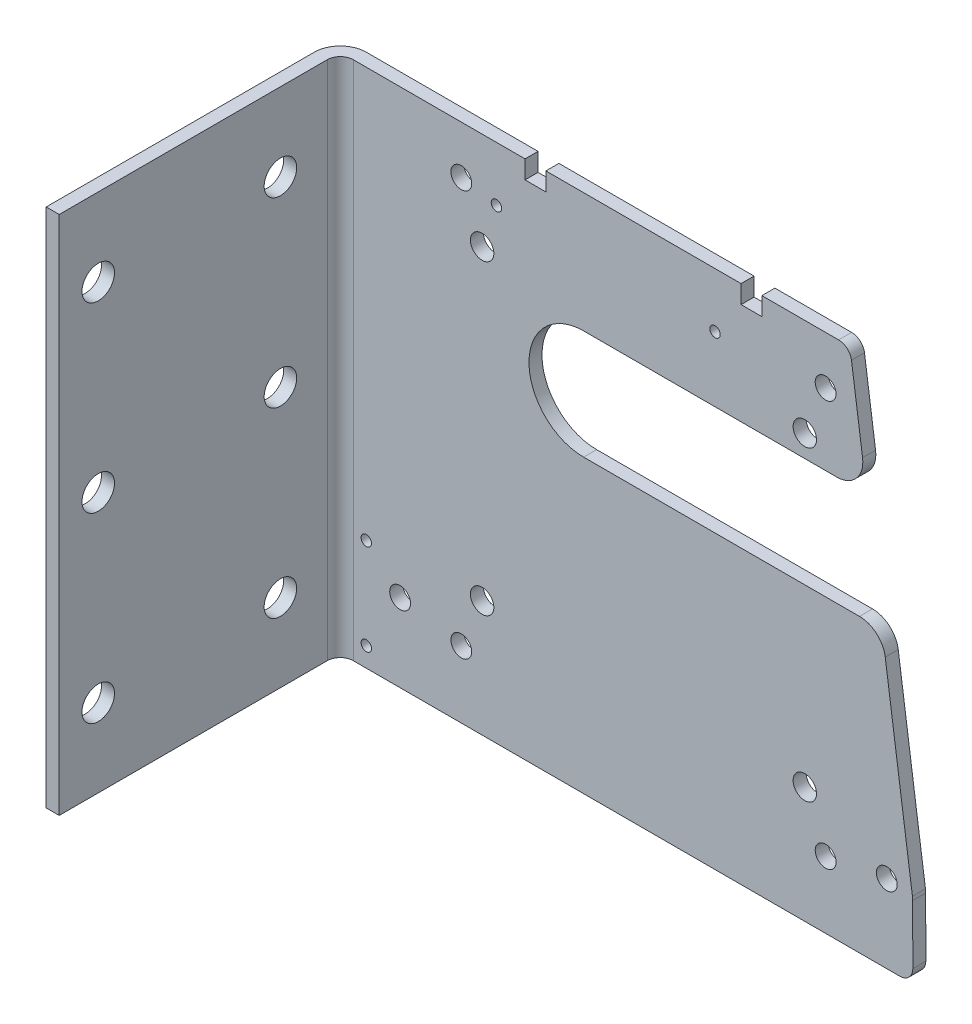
ISO-10303-21;
HEADER;
FILE_DESCRIPTION(('STEP AP214'),'2;1');
FILE_NAME('part.step','',(''),(''),'','','');
FILE_SCHEMA(('AUTOMOTIVE_DESIGN { 1 0 10303 214 1 1 1 1 }'));
ENDSEC;
DATA;
#1=APPLICATION_CONTEXT('core data for automotive mechanical design processes');
#2=APPLICATION_PROTOCOL_DEFINITION('international standard','automotive_design',2000,#1);
#3=PRODUCT_CONTEXT('',#1,'mechanical');
#4=PRODUCT('Part','Part','',(#3));
#5=PRODUCT_RELATED_PRODUCT_CATEGORY('part','',(#4));
#6=PRODUCT_DEFINITION_FORMATION('','',#4);
#7=PRODUCT_DEFINITION_CONTEXT('part definition',#1,'design');
#8=PRODUCT_DEFINITION('design','',#6,#7);
#9=PRODUCT_DEFINITION_SHAPE('','',#8);
#10=(LENGTH_UNIT() NAMED_UNIT(*) SI_UNIT(.MILLI.,.METRE.));
#11=(NAMED_UNIT(*) PLANE_ANGLE_UNIT() SI_UNIT($,.RADIAN.));
#12=(NAMED_UNIT(*) SI_UNIT($,.STERADIAN.) SOLID_ANGLE_UNIT());
#13=UNCERTAINTY_MEASURE_WITH_UNIT(LENGTH_MEASURE(1.E-05),#10,'distance_accuracy_value','');
#14=(GEOMETRIC_REPRESENTATION_CONTEXT(3) GLOBAL_UNCERTAINTY_ASSIGNED_CONTEXT((#13)) GLOBAL_UNIT_ASSIGNED_CONTEXT((#10,
#11,#12)) REPRESENTATION_CONTEXT('',''));
#15=CARTESIAN_POINT('',(0.,0.,0.));
#16=DIRECTION('',(0.,0.,1.));
#17=DIRECTION('',(1.,0.,0.));
#18=AXIS2_PLACEMENT_3D('',#15,#16,#17);
#19=CARTESIAN_POINT('',(74.9805427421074,91.4,5.));
#20=DIRECTION('',(0.,0.,-1.));
#21=DIRECTION('',(-1.,0.,0.));
#22=AXIS2_PLACEMENT_3D('',#19,#20,#21);
#23=PLANE('',#22);
#24=CARTESIAN_POINT('',(-93.5,-73.6,5.));
#25=DIRECTION('',(0.,0.,1.));
#26=DIRECTION('',(1.,0.,0.));
#27=AXIS2_PLACEMENT_3D('',#24,#25,#26);
#28=CIRCLE('',#27,4.00000000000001);
#29=CARTESIAN_POINT('',(-89.5,-73.6,5.));
#30=VERTEX_POINT('',#29);
#31=EDGE_CURVE('E263',#30,#30,#28,.T.);
#32=ORIENTED_EDGE('',*,*,#31,.F.);
#33=EDGE_LOOP('',(#32));
#34=FACE_BOUND('',#33,.T.);
#35=CARTESIAN_POINT('',(70.,-77.9,5.));
#36=DIRECTION('',(0.,0.,1.));
#37=DIRECTION('',(1.,0.,0.));
#38=AXIS2_PLACEMENT_3D('',#35,#36,#37);
#39=CIRCLE('',#38,4.00000000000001);
#40=CARTESIAN_POINT('',(74.,-77.9,5.));
#41=VERTEX_POINT('',#40);
#42=EDGE_CURVE('E276',#41,#41,#39,.T.);
#43=ORIENTED_EDGE('',*,*,#42,.F.);
#44=EDGE_LOOP('',(#43));
#45=FACE_BOUND('',#44,.T.);
#46=CARTESIAN_POINT('',(70.,77.9,5.));
#47=DIRECTION('',(0.,0.,1.));
#48=DIRECTION('',(1.,0.,0.));
#49=AXIS2_PLACEMENT_3D('',#46,#47,#48);
#50=CIRCLE('',#49,4.00000000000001);
#51=CARTESIAN_POINT('',(74.,77.9,5.));
#52=VERTEX_POINT('',#51);
#53=EDGE_CURVE('E288',#52,#52,#50,.T.);
#54=ORIENTED_EDGE('',*,*,#53,.F.);
#55=EDGE_LOOP('',(#54));
#56=FACE_BOUND('',#55,.T.);
#57=CARTESIAN_POINT('',(-62.0000000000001,58.9,5.));
#58=DIRECTION('',(0.,0.,1.));
#59=DIRECTION('',(1.,0.,0.));
#60=AXIS2_PLACEMENT_3D('',#57,#58,#59);
#61=CIRCLE('',#60,4.5);
#62=CARTESIAN_POINT('',(-57.5000000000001,58.9,5.));
#63=VERTEX_POINT('',#62);
#64=EDGE_CURVE('E300',#63,#63,#61,.T.);
#65=ORIENTED_EDGE('',*,*,#64,.F.);
#66=EDGE_LOOP('',(#65));
#67=FACE_BOUND('',#66,.T.);
#68=CARTESIAN_POINT('',(62.,-58.9,5.));
#69=DIRECTION('',(0.,0.,1.));
#70=DIRECTION('',(1.,0.,0.));
#71=AXIS2_PLACEMENT_3D('',#68,#69,#70);
#72=CIRCLE('',#71,4.49999999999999);
#73=CARTESIAN_POINT('',(66.5,-58.9,5.));
#74=VERTEX_POINT('',#73);
#75=EDGE_CURVE('E312',#74,#74,#72,.T.);
#76=ORIENTED_EDGE('',*,*,#75,.F.);
#77=EDGE_LOOP('',(#76));
#78=FACE_BOUND('',#77,.T.);
#79=CARTESIAN_POINT('',(-62.,-58.9,5.));
#80=DIRECTION('',(0.,0.,1.));
#81=DIRECTION('',(1.,0.,0.));
#82=AXIS2_PLACEMENT_3D('',#79,#80,#81);
#83=CIRCLE('',#82,4.5);
#84=CARTESIAN_POINT('',(-57.5,-58.9,5.));
#85=VERTEX_POINT('',#84);
#86=EDGE_CURVE('E318',#85,#85,#83,.T.);
#87=ORIENTED_EDGE('',*,*,#86,.F.);
#88=EDGE_LOOP('',(#87));
#89=FACE_BOUND('',#88,.T.);
#90=CARTESIAN_POINT('',(62.0000000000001,58.9,5.));
#91=DIRECTION('',(0.,0.,1.));
#92=DIRECTION('',(1.,0.,0.));
#93=AXIS2_PLACEMENT_3D('',#90,#91,#92);
#94=CIRCLE('',#93,4.49999999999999);
#95=CARTESIAN_POINT('',(66.5000000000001,58.9,5.));
#96=VERTEX_POINT('',#95);
#97=EDGE_CURVE('E306',#96,#96,#94,.T.);
#98=ORIENTED_EDGE('',*,*,#97,.F.);
#99=EDGE_LOOP('',(#98));
#100=FACE_BOUND('',#99,.T.);
#101=CARTESIAN_POINT('',(-70.,77.9,5.));
#102=DIRECTION('',(0.,0.,1.));
#103=DIRECTION('',(1.,0.,0.));
#104=AXIS2_PLACEMENT_3D('',#101,#102,#103);
#105=CIRCLE('',#104,4.00000000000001);
#106=CARTESIAN_POINT('',(-66.,77.9,5.));
#107=VERTEX_POINT('',#106);
#108=EDGE_CURVE('E294',#107,#107,#105,.T.);
#109=ORIENTED_EDGE('',*,*,#108,.F.);
#110=EDGE_LOOP('',(#109));
#111=FACE_BOUND('',#110,.T.);
#112=CARTESIAN_POINT('',(93.5,-73.6,5.));
#113=DIRECTION('',(0.,0.,1.));
#114=DIRECTION('',(1.,0.,0.));
#115=AXIS2_PLACEMENT_3D('',#112,#113,#114);
#116=CIRCLE('',#115,4.00000000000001);
#117=CARTESIAN_POINT('',(97.5,-73.6,5.));
#118=VERTEX_POINT('',#117);
#119=EDGE_CURVE('E282',#118,#118,#116,.T.);
#120=ORIENTED_EDGE('',*,*,#119,.F.);
#121=EDGE_LOOP('',(#120));
#122=FACE_BOUND('',#121,.T.);
#123=CARTESIAN_POINT('',(-70.,-77.9,5.));
#124=DIRECTION('',(0.,0.,1.));
#125=DIRECTION('',(1.,0.,0.));
#126=AXIS2_PLACEMENT_3D('',#123,#124,#125);
#127=CIRCLE('',#126,4.00000000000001);
#128=CARTESIAN_POINT('',(-66.,-77.9,5.));
#129=VERTEX_POINT('',#128);
#130=EDGE_CURVE('E270',#129,#129,#127,.T.);
#131=ORIENTED_EDGE('',*,*,#130,.F.);
#132=EDGE_LOOP('',(#131));
#133=FACE_BOUND('',#132,.T.);
#134=CARTESIAN_POINT('',(-106.5,-96.1,5.));
#135=DIRECTION('',(0.,0.,1.));
#136=DIRECTION('',(1.,0.,0.));
#137=AXIS2_PLACEMENT_3D('',#134,#135,#136);
#138=CIRCLE('',#137,2.);
#139=CARTESIAN_POINT('',(-104.5,-96.1,5.));
#140=VERTEX_POINT('',#139);
#141=EDGE_CURVE('E259',#140,#140,#138,.T.);
#142=ORIENTED_EDGE('',*,*,#141,.F.);
#143=EDGE_LOOP('',(#142));
#144=FACE_BOUND('',#143,.T.);
#145=CARTESIAN_POINT('',(-106.5,-61.1,5.));
#146=DIRECTION('',(0.,0.,1.));
#147=DIRECTION('',(1.,0.,0.));
#148=AXIS2_PLACEMENT_3D('',#145,#146,#147);
#149=CIRCLE('',#148,2.);
#150=CARTESIAN_POINT('',(-104.5,-61.1,5.));
#151=VERTEX_POINT('',#150);
#152=EDGE_CURVE('E255',#151,#151,#149,.T.);
#153=ORIENTED_EDGE('',*,*,#152,.F.);
#154=EDGE_LOOP('',(#153));
#155=FACE_BOUND('',#154,.T.);
#156=CARTESIAN_POINT('',(27.5,75.4,5.));
#157=DIRECTION('',(0.,0.,1.));
#158=DIRECTION('',(1.,0.,0.));
#159=AXIS2_PLACEMENT_3D('',#156,#157,#158);
#160=CIRCLE('',#159,1.99999999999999);
#161=CARTESIAN_POINT('',(29.5,75.4,5.));
#162=VERTEX_POINT('',#161);
#163=EDGE_CURVE('E251',#162,#162,#160,.T.);
#164=ORIENTED_EDGE('',*,*,#163,.F.);
#165=EDGE_LOOP('',(#164));
#166=FACE_BOUND('',#165,.T.);
#167=CARTESIAN_POINT('',(-56.5,75.4,5.));
#168=DIRECTION('',(0.,0.,1.));
#169=DIRECTION('',(1.,0.,0.));
#170=AXIS2_PLACEMENT_3D('',#167,#168,#169);
#171=CIRCLE('',#170,1.99999999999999);
#172=CARTESIAN_POINT('',(-54.5,75.4,5.));
#173=VERTEX_POINT('',#172);
#174=EDGE_CURVE('E247',#173,#173,#171,.T.);
#175=ORIENTED_EDGE('',*,*,#174,.F.);
#176=EDGE_LOOP('',(#175));
#177=FACE_BOUND('',#176,.T.);
#178=DIRECTION('',(-1.,0.,0.));
#179=VECTOR('',#178,1.);
#180=CARTESIAN_POINT('',(-121.5,96.4,5.));
#181=LINE('',#180,#179);
#182=CARTESIAN_POINT('',(-45.5,96.4,5.));
#183=VERTEX_POINT('',#182);
#184=CARTESIAN_POINT('',(-111.5,96.4,5.));
#185=VERTEX_POINT('',#184);
#186=EDGE_CURVE('E324',#183,#185,#181,.T.);
#187=ORIENTED_EDGE('',*,*,#186,.T.);
#188=DIRECTION('',(0.,1.,0.));
#189=VECTOR('',#188,1.);
#190=CARTESIAN_POINT('',(-111.5,-103.6,5.));
#191=LINE('',#190,#189);
#192=CARTESIAN_POINT('',(-111.5,-103.6,5.));
#193=VERTEX_POINT('',#192);
#194=EDGE_CURVE('E57',#185,#193,#191,.F.);
#195=ORIENTED_EDGE('',*,*,#194,.T.);
#196=DIRECTION('',(1.,0.,0.));
#197=VECTOR('',#196,1.);
#198=CARTESIAN_POINT('',(-121.5,-103.6,5.));
#199=LINE('',#198,#197);
#200=CARTESIAN_POINT('',(98.4914095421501,-103.6,5.));
#201=VERTEX_POINT('',#200);
#202=EDGE_CURVE('E326',#193,#201,#199,.T.);
#203=ORIENTED_EDGE('',*,*,#202,.T.);
#204=CARTESIAN_POINT('',(98.4914095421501,-98.6,5.));
#205=DIRECTION('',(0.,0.,1.));
#206=DIRECTION('',(1.,0.,0.));
#207=AXIS2_PLACEMENT_3D('',#204,#205,#206);
#208=CIRCLE('',#207,4.99999999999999);
#209=CARTESIAN_POINT('',(103.491402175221,-98.5914169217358,5.));
#210=VERTEX_POINT('',#209);
#211=EDGE_CURVE('E329',#201,#210,#208,.T.);
#212=ORIENTED_EDGE('',*,*,#211,.T.);
#213=DIRECTION('',(-0.00171661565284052,0.999998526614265,0.));
#214=VECTOR('',#213,1.);
#215=CARTESIAN_POINT('',(103.491402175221,-98.5914169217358,5.));
#216=LINE('',#215,#214);
#217=CARTESIAN_POINT('',(103.452525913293,-75.9444111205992,5.));
#218=VERTEX_POINT('',#217);
#219=EDGE_CURVE('E331',#210,#218,#216,.T.);
#220=ORIENTED_EDGE('',*,*,#219,.T.);
#221=CARTESIAN_POINT('',(93.4525406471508,-75.9615772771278,5.));
#222=DIRECTION('',(0.,0.,1.));
#223=DIRECTION('',(-1.,0.,0.));
#224=AXIS2_PLACEMENT_3D('',#221,#222,#223);
#225=CIRCLE('',#224,10.);
#226=CARTESIAN_POINT('',(103.355221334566,-74.569846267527,5.));
#227=VERTEX_POINT('',#226);
#228=EDGE_CURVE('E333',#218,#227,#225,.T.);
#229=ORIENTED_EDGE('',*,*,#228,.T.);
#230=DIRECTION('',(-0.139173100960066,0.99026806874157,0.));
#231=VECTOR('',#230,1.);
#232=CARTESIAN_POINT('',(103.355221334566,-74.569846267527,5.));
#233=LINE('',#232,#231);
#234=CARTESIAN_POINT('',(92.9043831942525,-0.20826899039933,5.));
#235=VERTEX_POINT('',#234);
#236=EDGE_CURVE('E335',#227,#235,#233,.T.);
#237=ORIENTED_EDGE('',*,*,#236,.T.);
#238=CARTESIAN_POINT('',(83.0017025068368,-1.59999999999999,5.));
#239=DIRECTION('',(0.,0.,1.));
#240=DIRECTION('',(1.,0.,0.));
#241=AXIS2_PLACEMENT_3D('',#238,#239,#240);
#242=CIRCLE('',#241,9.99999999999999);
#243=CARTESIAN_POINT('',(83.0017025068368,8.4,5.));
#244=VERTEX_POINT('',#243);
#245=EDGE_CURVE('E337',#235,#244,#242,.T.);
#246=ORIENTED_EDGE('',*,*,#245,.T.);
#247=DIRECTION('',(-1.,0.,0.));
#248=VECTOR('',#247,1.);
#249=CARTESIAN_POINT('',(-22.994,8.4,5.));
#250=LINE('',#249,#248);
#251=CARTESIAN_POINT('',(-22.994,8.4,5.));
#252=VERTEX_POINT('',#251);
#253=EDGE_CURVE('E339',#244,#252,#250,.T.);
#254=ORIENTED_EDGE('',*,*,#253,.T.);
#255=CARTESIAN_POINT('',(-22.994,29.4,5.));
#256=DIRECTION('',(0.,0.,-1.));
#257=DIRECTION('',(1.,0.,0.));
#258=AXIS2_PLACEMENT_3D('',#255,#256,#257);
#259=CIRCLE('',#258,21.);
#260=CARTESIAN_POINT('',(-22.994,50.4,5.));
#261=VERTEX_POINT('',#260);
#262=EDGE_CURVE('E341',#252,#261,#259,.T.);
#263=ORIENTED_EDGE('',*,*,#262,.T.);
#264=DIRECTION('',(1.,0.,0.));
#265=VECTOR('',#264,1.);
#266=CARTESIAN_POINT('',(-22.994,50.4,5.));
#267=LINE('',#266,#265);
#268=CARTESIAN_POINT('',(74.2881707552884,50.4,5.));
#269=VERTEX_POINT('',#268);
#270=EDGE_CURVE('E343',#261,#269,#267,.T.);
#271=ORIENTED_EDGE('',*,*,#270,.T.);
#272=CARTESIAN_POINT('',(74.2881707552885,60.4,5.));
#273=DIRECTION('',(0.,0.,1.));
#274=DIRECTION('',(1.,0.,0.));
#275=AXIS2_PLACEMENT_3D('',#272,#273,#274);
#276=CIRCLE('',#275,10.);
#277=CARTESIAN_POINT('',(84.1908514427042,61.7917310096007,5.));
#278=VERTEX_POINT('',#277);
#279=EDGE_CURVE('E345',#269,#278,#276,.T.);
#280=ORIENTED_EDGE('',*,*,#279,.T.);
#281=DIRECTION('',(-0.139173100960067,0.99026806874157,0.));
#282=VECTOR('',#281,1.);
#283=CARTESIAN_POINT('',(84.1908514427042,61.7917310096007,5.));
#284=LINE('',#283,#282);
#285=CARTESIAN_POINT('',(79.9318830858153,92.0958655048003,5.));
#286=VERTEX_POINT('',#285);
#287=EDGE_CURVE('E347',#278,#286,#284,.T.);
#288=ORIENTED_EDGE('',*,*,#287,.T.);
#289=CARTESIAN_POINT('',(74.9805427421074,91.4,5.));
#290=DIRECTION('',(0.,0.,1.));
#291=DIRECTION('',(-1.,0.,0.));
#292=AXIS2_PLACEMENT_3D('',#289,#290,#291);
#293=CIRCLE('',#292,5.);
#294=CARTESIAN_POINT('',(74.9805427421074,96.4,5.));
#295=VERTEX_POINT('',#294);
#296=EDGE_CURVE('E349',#286,#295,#293,.T.);
#297=ORIENTED_EDGE('',*,*,#296,.T.);
#298=DIRECTION('',(-1.,0.,0.));
#299=VECTOR('',#298,1.);
#300=CARTESIAN_POINT('',(45.5,96.4,5.));
#301=LINE('',#300,#299);
#302=CARTESIAN_POINT('',(45.5,96.4,5.));
#303=VERTEX_POINT('',#302);
#304=EDGE_CURVE('E351',#295,#303,#301,.T.);
#305=ORIENTED_EDGE('',*,*,#304,.T.);
#306=DIRECTION('',(0.,-1.,0.));
#307=VECTOR('',#306,1.);
#308=CARTESIAN_POINT('',(45.5,96.4,5.));
#309=LINE('',#308,#307);
#310=CARTESIAN_POINT('',(45.5,89.4,5.));
#311=VERTEX_POINT('',#310);
#312=EDGE_CURVE('E353',#303,#311,#309,.T.);
#313=ORIENTED_EDGE('',*,*,#312,.T.);
#314=DIRECTION('',(-1.,0.,0.));
#315=VECTOR('',#314,1.);
#316=CARTESIAN_POINT('',(45.5,89.4,5.));
#317=LINE('',#316,#315);
#318=CARTESIAN_POINT('',(37.5,89.4,5.));
#319=VERTEX_POINT('',#318);
#320=EDGE_CURVE('E355',#311,#319,#317,.T.);
#321=ORIENTED_EDGE('',*,*,#320,.T.);
#322=DIRECTION('',(0.,1.,0.));
#323=VECTOR('',#322,1.);
#324=CARTESIAN_POINT('',(37.5,89.4,5.));
#325=LINE('',#324,#323);
#326=CARTESIAN_POINT('',(37.5,96.4,5.));
#327=VERTEX_POINT('',#326);
#328=EDGE_CURVE('E357',#319,#327,#325,.T.);
#329=ORIENTED_EDGE('',*,*,#328,.T.);
#330=DIRECTION('',(-1.,0.,0.));
#331=VECTOR('',#330,1.);
#332=CARTESIAN_POINT('',(37.5,96.4,5.));
#333=LINE('',#332,#331);
#334=CARTESIAN_POINT('',(-37.5,96.4,5.));
#335=VERTEX_POINT('',#334);
#336=EDGE_CURVE('E359',#327,#335,#333,.T.);
#337=ORIENTED_EDGE('',*,*,#336,.T.);
#338=DIRECTION('',(0.,-1.,0.));
#339=VECTOR('',#338,1.);
#340=CARTESIAN_POINT('',(-37.5,96.4,5.));
#341=LINE('',#340,#339);
#342=CARTESIAN_POINT('',(-37.5,89.4,5.));
#343=VERTEX_POINT('',#342);
#344=EDGE_CURVE('E361',#335,#343,#341,.T.);
#345=ORIENTED_EDGE('',*,*,#344,.T.);
#346=DIRECTION('',(-1.,0.,0.));
#347=VECTOR('',#346,1.);
#348=CARTESIAN_POINT('',(-37.5,89.4,5.));
#349=LINE('',#348,#347);
#350=CARTESIAN_POINT('',(-45.5,89.4,5.));
#351=VERTEX_POINT('',#350);
#352=EDGE_CURVE('E363',#343,#351,#349,.T.);
#353=ORIENTED_EDGE('',*,*,#352,.T.);
#354=DIRECTION('',(0.,1.,0.));
#355=VECTOR('',#354,1.);
#356=CARTESIAN_POINT('',(-45.5,89.4,5.));
#357=LINE('',#356,#355);
#358=EDGE_CURVE('E365',#351,#183,#357,.T.);
#359=ORIENTED_EDGE('',*,*,#358,.T.);
#360=EDGE_LOOP('',(#187,#195,#203,#212,#220,#229,#237,#246,#254,#263,#271,#280,#288,#297,#305,
#313,#321,#329,#337,#345,#353,#359));
#361=FACE_BOUND('',#360,.T.);
#362=ADVANCED_FACE('F34',(#34,#45,#56,#67,#78,#89,#100,#111,#122,#133,#144,#155,#166,#177,#361),
#23,.F.);
#363=CARTESIAN_POINT('',(74.9805427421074,91.4,0.));
#364=DIRECTION('',(0.,0.,-1.));
#365=DIRECTION('',(-1.,0.,0.));
#366=AXIS2_PLACEMENT_3D('',#363,#364,#365);
#367=PLANE('',#366);
#368=CARTESIAN_POINT('',(-56.5,75.4,0.));
#369=DIRECTION('',(0.,0.,-1.));
#370=DIRECTION('',(-1.,0.,0.));
#371=AXIS2_PLACEMENT_3D('',#368,#369,#370);
#372=CIRCLE('',#371,1.99999999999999);
#373=CARTESIAN_POINT('',(-58.5,75.4,0.));
#374=VERTEX_POINT('',#373);
#375=EDGE_CURVE('E250',#374,#374,#372,.T.);
#376=ORIENTED_EDGE('',*,*,#375,.F.);
#377=EDGE_LOOP('',(#376));
#378=FACE_BOUND('',#377,.T.);
#379=CARTESIAN_POINT('',(27.5,75.4,0.));
#380=DIRECTION('',(0.,0.,-1.));
#381=DIRECTION('',(-1.,0.,0.));
#382=AXIS2_PLACEMENT_3D('',#379,#380,#381);
#383=CIRCLE('',#382,1.99999999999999);
#384=CARTESIAN_POINT('',(25.5,75.4,0.));
#385=VERTEX_POINT('',#384);
#386=EDGE_CURVE('E254',#385,#385,#383,.T.);
#387=ORIENTED_EDGE('',*,*,#386,.F.);
#388=EDGE_LOOP('',(#387));
#389=FACE_BOUND('',#388,.T.);
#390=CARTESIAN_POINT('',(-106.5,-61.1,0.));
#391=DIRECTION('',(0.,0.,-1.));
#392=DIRECTION('',(-1.,0.,0.));
#393=AXIS2_PLACEMENT_3D('',#390,#391,#392);
#394=CIRCLE('',#393,2.);
#395=CARTESIAN_POINT('',(-108.5,-61.1,0.));
#396=VERTEX_POINT('',#395);
#397=EDGE_CURVE('E258',#396,#396,#394,.T.);
#398=ORIENTED_EDGE('',*,*,#397,.F.);
#399=EDGE_LOOP('',(#398));
#400=FACE_BOUND('',#399,.T.);
#401=CARTESIAN_POINT('',(-106.5,-96.1,0.));
#402=DIRECTION('',(0.,0.,-1.));
#403=DIRECTION('',(-1.,0.,0.));
#404=AXIS2_PLACEMENT_3D('',#401,#402,#403);
#405=CIRCLE('',#404,2.);
#406=CARTESIAN_POINT('',(-108.5,-96.1,0.));
#407=VERTEX_POINT('',#406);
#408=EDGE_CURVE('E262',#407,#407,#405,.T.);
#409=ORIENTED_EDGE('',*,*,#408,.F.);
#410=EDGE_LOOP('',(#409));
#411=FACE_BOUND('',#410,.T.);
#412=CARTESIAN_POINT('',(-70.,-77.9,0.));
#413=DIRECTION('',(0.,0.,1.));
#414=DIRECTION('',(1.,0.,0.));
#415=AXIS2_PLACEMENT_3D('',#412,#413,#414);
#416=CIRCLE('',#415,4.00000000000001);
#417=CARTESIAN_POINT('',(-66.,-77.9,0.));
#418=VERTEX_POINT('',#417);
#419=EDGE_CURVE('E266',#418,#418,#416,.T.);
#420=ORIENTED_EDGE('',*,*,#419,.T.);
#421=EDGE_LOOP('',(#420));
#422=FACE_BOUND('',#421,.T.);
#423=CARTESIAN_POINT('',(93.5,-73.6,0.));
#424=DIRECTION('',(0.,0.,1.));
#425=DIRECTION('',(1.,0.,0.));
#426=AXIS2_PLACEMENT_3D('',#423,#424,#425);
#427=CIRCLE('',#426,4.00000000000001);
#428=CARTESIAN_POINT('',(97.5,-73.6,0.));
#429=VERTEX_POINT('',#428);
#430=EDGE_CURVE('E279',#429,#429,#427,.T.);
#431=ORIENTED_EDGE('',*,*,#430,.T.);
#432=EDGE_LOOP('',(#431));
#433=FACE_BOUND('',#432,.T.);
#434=CARTESIAN_POINT('',(-70.,77.9,0.));
#435=DIRECTION('',(0.,0.,1.));
#436=DIRECTION('',(1.,0.,0.));
#437=AXIS2_PLACEMENT_3D('',#434,#435,#436);
#438=CIRCLE('',#437,4.00000000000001);
#439=CARTESIAN_POINT('',(-66.,77.9,0.));
#440=VERTEX_POINT('',#439);
#441=EDGE_CURVE('E291',#440,#440,#438,.T.);
#442=ORIENTED_EDGE('',*,*,#441,.T.);
#443=EDGE_LOOP('',(#442));
#444=FACE_BOUND('',#443,.T.);
#445=CARTESIAN_POINT('',(62.0000000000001,58.9,0.));
#446=DIRECTION('',(0.,0.,1.));
#447=DIRECTION('',(1.,0.,0.));
#448=AXIS2_PLACEMENT_3D('',#445,#446,#447);
#449=CIRCLE('',#448,4.49999999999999);
#450=CARTESIAN_POINT('',(66.5000000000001,58.9,0.));
#451=VERTEX_POINT('',#450);
#452=EDGE_CURVE('E303',#451,#451,#449,.T.);
#453=ORIENTED_EDGE('',*,*,#452,.T.);
#454=EDGE_LOOP('',(#453));
#455=FACE_BOUND('',#454,.T.);
#456=CARTESIAN_POINT('',(-62.,-58.9,0.));
#457=DIRECTION('',(0.,0.,1.));
#458=DIRECTION('',(1.,0.,0.));
#459=AXIS2_PLACEMENT_3D('',#456,#457,#458);
#460=CIRCLE('',#459,4.5);
#461=CARTESIAN_POINT('',(-57.5,-58.9,0.));
#462=VERTEX_POINT('',#461);
#463=EDGE_CURVE('E315',#462,#462,#460,.T.);
#464=ORIENTED_EDGE('',*,*,#463,.T.);
#465=EDGE_LOOP('',(#464));
#466=FACE_BOUND('',#465,.T.);
#467=DIRECTION('',(1.,0.,0.));
#468=VECTOR('',#467,1.);
#469=CARTESIAN_POINT('',(-121.5,-103.6,0.));
#470=LINE('',#469,#468);
#471=CARTESIAN_POINT('',(-111.5,-103.6,0.));
#472=VERTEX_POINT('',#471);
#473=CARTESIAN_POINT('',(98.4914095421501,-103.6,0.));
#474=VERTEX_POINT('',#473);
#475=EDGE_CURVE('E370',#472,#474,#470,.T.);
#476=ORIENTED_EDGE('',*,*,#475,.F.);
#477=DIRECTION('',(0.,-1.,0.));
#478=VECTOR('',#477,1.);
#479=CARTESIAN_POINT('',(-111.5,96.4,0.));
#480=LINE('',#479,#478);
#481=CARTESIAN_POINT('',(-111.5,96.4,0.));
#482=VERTEX_POINT('',#481);
#483=EDGE_CURVE('E479',#472,#482,#480,.F.);
#484=ORIENTED_EDGE('',*,*,#483,.T.);
#485=DIRECTION('',(-1.,0.,0.));
#486=VECTOR('',#485,1.);
#487=CARTESIAN_POINT('',(-121.5,96.4,0.));
#488=LINE('',#487,#486);
#489=CARTESIAN_POINT('',(-45.5,96.4,0.));
#490=VERTEX_POINT('',#489);
#491=EDGE_CURVE('E321',#490,#482,#488,.T.);
#492=ORIENTED_EDGE('',*,*,#491,.F.);
#493=DIRECTION('',(0.,1.,0.));
#494=VECTOR('',#493,1.);
#495=CARTESIAN_POINT('',(-45.5,89.4,0.));
#496=LINE('',#495,#494);
#497=CARTESIAN_POINT('',(-45.5,89.4,0.));
#498=VERTEX_POINT('',#497);
#499=EDGE_CURVE('E327',#498,#490,#496,.T.);
#500=ORIENTED_EDGE('',*,*,#499,.F.);
#501=DIRECTION('',(-1.,0.,0.));
#502=VECTOR('',#501,1.);
#503=CARTESIAN_POINT('',(-37.5,89.4,0.));
#504=LINE('',#503,#502);
#505=CARTESIAN_POINT('',(-37.5,89.4,0.));
#506=VERTEX_POINT('',#505);
#507=EDGE_CURVE('E406',#506,#498,#504,.T.);
#508=ORIENTED_EDGE('',*,*,#507,.F.);
#509=DIRECTION('',(0.,-1.,0.));
#510=VECTOR('',#509,1.);
#511=CARTESIAN_POINT('',(-37.5,96.4,0.));
#512=LINE('',#511,#510);
#513=CARTESIAN_POINT('',(-37.5,96.4,0.));
#514=VERTEX_POINT('',#513);
#515=EDGE_CURVE('E404',#514,#506,#512,.T.);
#516=ORIENTED_EDGE('',*,*,#515,.F.);
#517=DIRECTION('',(-1.,0.,0.));
#518=VECTOR('',#517,1.);
#519=CARTESIAN_POINT('',(37.5,96.4,0.));
#520=LINE('',#519,#518);
#521=CARTESIAN_POINT('',(37.5,96.4,0.));
#522=VERTEX_POINT('',#521);
#523=EDGE_CURVE('E402',#522,#514,#520,.T.);
#524=ORIENTED_EDGE('',*,*,#523,.F.);
#525=DIRECTION('',(0.,1.,0.));
#526=VECTOR('',#525,1.);
#527=CARTESIAN_POINT('',(37.5,89.4,0.));
#528=LINE('',#527,#526);
#529=CARTESIAN_POINT('',(37.5,89.4,0.));
#530=VERTEX_POINT('',#529);
#531=EDGE_CURVE('E400',#530,#522,#528,.T.);
#532=ORIENTED_EDGE('',*,*,#531,.F.);
#533=DIRECTION('',(-1.,0.,0.));
#534=VECTOR('',#533,1.);
#535=CARTESIAN_POINT('',(45.5,89.4,0.));
#536=LINE('',#535,#534);
#537=CARTESIAN_POINT('',(45.5,89.4,0.));
#538=VERTEX_POINT('',#537);
#539=EDGE_CURVE('E398',#538,#530,#536,.T.);
#540=ORIENTED_EDGE('',*,*,#539,.F.);
#541=DIRECTION('',(0.,-1.,0.));
#542=VECTOR('',#541,1.);
#543=CARTESIAN_POINT('',(45.5,96.4,0.));
#544=LINE('',#543,#542);
#545=CARTESIAN_POINT('',(45.5,96.4,0.));
#546=VERTEX_POINT('',#545);
#547=EDGE_CURVE('E396',#546,#538,#544,.T.);
#548=ORIENTED_EDGE('',*,*,#547,.F.);
#549=DIRECTION('',(-1.,0.,0.));
#550=VECTOR('',#549,1.);
#551=CARTESIAN_POINT('',(45.5,96.4,0.));
#552=LINE('',#551,#550);
#553=CARTESIAN_POINT('',(74.9805427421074,96.4,0.));
#554=VERTEX_POINT('',#553);
#555=EDGE_CURVE('E394',#554,#546,#552,.T.);
#556=ORIENTED_EDGE('',*,*,#555,.F.);
#557=CARTESIAN_POINT('',(74.9805427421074,91.4,0.));
#558=DIRECTION('',(0.,0.,1.));
#559=DIRECTION('',(-1.,0.,0.));
#560=AXIS2_PLACEMENT_3D('',#557,#558,#559);
#561=CIRCLE('',#560,5.);
#562=CARTESIAN_POINT('',(79.9318830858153,92.0958655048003,0.));
#563=VERTEX_POINT('',#562);
#564=EDGE_CURVE('E392',#563,#554,#561,.T.);
#565=ORIENTED_EDGE('',*,*,#564,.F.);
#566=DIRECTION('',(-0.139173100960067,0.99026806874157,0.));
#567=VECTOR('',#566,1.);
#568=CARTESIAN_POINT('',(84.1908514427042,61.7917310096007,0.));
#569=LINE('',#568,#567);
#570=CARTESIAN_POINT('',(84.1908514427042,61.7917310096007,0.));
#571=VERTEX_POINT('',#570);
#572=EDGE_CURVE('E390',#571,#563,#569,.T.);
#573=ORIENTED_EDGE('',*,*,#572,.F.);
#574=CARTESIAN_POINT('',(74.2881707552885,60.4,0.));
#575=DIRECTION('',(0.,0.,1.));
#576=DIRECTION('',(1.,0.,0.));
#577=AXIS2_PLACEMENT_3D('',#574,#575,#576);
#578=CIRCLE('',#577,10.);
#579=CARTESIAN_POINT('',(74.2881707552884,50.4,0.));
#580=VERTEX_POINT('',#579);
#581=EDGE_CURVE('E388',#580,#571,#578,.T.);
#582=ORIENTED_EDGE('',*,*,#581,.F.);
#583=DIRECTION('',(1.,0.,0.));
#584=VECTOR('',#583,1.);
#585=CARTESIAN_POINT('',(-22.994,50.4,0.));
#586=LINE('',#585,#584);
#587=CARTESIAN_POINT('',(-22.994,50.4,0.));
#588=VERTEX_POINT('',#587);
#589=EDGE_CURVE('E386',#588,#580,#586,.T.);
#590=ORIENTED_EDGE('',*,*,#589,.F.);
#591=CARTESIAN_POINT('',(-22.994,29.4,0.));
#592=DIRECTION('',(0.,0.,-1.));
#593=DIRECTION('',(1.,0.,0.));
#594=AXIS2_PLACEMENT_3D('',#591,#592,#593);
#595=CIRCLE('',#594,21.);
#596=CARTESIAN_POINT('',(-22.994,8.4,0.));
#597=VERTEX_POINT('',#596);
#598=EDGE_CURVE('E384',#597,#588,#595,.T.);
#599=ORIENTED_EDGE('',*,*,#598,.F.);
#600=DIRECTION('',(-1.,0.,0.));
#601=VECTOR('',#600,1.);
#602=CARTESIAN_POINT('',(-22.994,8.4,0.));
#603=LINE('',#602,#601);
#604=CARTESIAN_POINT('',(83.0017025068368,8.4,0.));
#605=VERTEX_POINT('',#604);
#606=EDGE_CURVE('E382',#605,#597,#603,.T.);
#607=ORIENTED_EDGE('',*,*,#606,.F.);
#608=CARTESIAN_POINT('',(83.0017025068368,-1.59999999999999,0.));
#609=DIRECTION('',(0.,0.,1.));
#610=DIRECTION('',(1.,0.,0.));
#611=AXIS2_PLACEMENT_3D('',#608,#609,#610);
#612=CIRCLE('',#611,9.99999999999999);
#613=CARTESIAN_POINT('',(92.9043831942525,-0.20826899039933,0.));
#614=VERTEX_POINT('',#613);
#615=EDGE_CURVE('E380',#614,#605,#612,.T.);
#616=ORIENTED_EDGE('',*,*,#615,.F.);
#617=DIRECTION('',(-0.139173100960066,0.99026806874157,0.));
#618=VECTOR('',#617,1.);
#619=CARTESIAN_POINT('',(103.355221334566,-74.569846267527,0.));
#620=LINE('',#619,#618);
#621=CARTESIAN_POINT('',(103.355221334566,-74.569846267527,0.));
#622=VERTEX_POINT('',#621);
#623=EDGE_CURVE('E378',#622,#614,#620,.T.);
#624=ORIENTED_EDGE('',*,*,#623,.F.);
#625=CARTESIAN_POINT('',(93.4525406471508,-75.9615772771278,0.));
#626=DIRECTION('',(0.,0.,1.));
#627=DIRECTION('',(-1.,0.,0.));
#628=AXIS2_PLACEMENT_3D('',#625,#626,#627);
#629=CIRCLE('',#628,10.);
#630=CARTESIAN_POINT('',(103.452525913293,-75.9444111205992,0.));
#631=VERTEX_POINT('',#630);
#632=EDGE_CURVE('E376',#631,#622,#629,.T.);
#633=ORIENTED_EDGE('',*,*,#632,.F.);
#634=DIRECTION('',(-0.00171661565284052,0.999998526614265,0.));
#635=VECTOR('',#634,1.);
#636=CARTESIAN_POINT('',(103.491402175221,-98.5914169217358,0.));
#637=LINE('',#636,#635);
#638=CARTESIAN_POINT('',(103.491402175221,-98.5914169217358,0.));
#639=VERTEX_POINT('',#638);
#640=EDGE_CURVE('E374',#639,#631,#637,.T.);
#641=ORIENTED_EDGE('',*,*,#640,.F.);
#642=CARTESIAN_POINT('',(98.4914095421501,-98.6,0.));
#643=DIRECTION('',(0.,0.,1.));
#644=DIRECTION('',(1.,0.,0.));
#645=AXIS2_PLACEMENT_3D('',#642,#643,#644);
#646=CIRCLE('',#645,4.99999999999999);
#647=EDGE_CURVE('E372',#474,#639,#646,.T.);
#648=ORIENTED_EDGE('',*,*,#647,.F.);
#649=EDGE_LOOP('',(#476,#484,#492,#500,#508,#516,#524,#532,#540,#548,#556,#565,#573,#582,#590,
#599,#607,#616,#624,#633,#641,#648));
#650=FACE_BOUND('',#649,.T.);
#651=CARTESIAN_POINT('',(62.,-58.9,0.));
#652=DIRECTION('',(0.,0.,1.));
#653=DIRECTION('',(1.,0.,0.));
#654=AXIS2_PLACEMENT_3D('',#651,#652,#653);
#655=CIRCLE('',#654,4.49999999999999);
#656=CARTESIAN_POINT('',(66.5,-58.9,0.));
#657=VERTEX_POINT('',#656);
#658=EDGE_CURVE('E309',#657,#657,#655,.T.);
#659=ORIENTED_EDGE('',*,*,#658,.T.);
#660=EDGE_LOOP('',(#659));
#661=FACE_BOUND('',#660,.T.);
#662=CARTESIAN_POINT('',(-62.0000000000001,58.9,0.));
#663=DIRECTION('',(0.,0.,1.));
#664=DIRECTION('',(1.,0.,0.));
#665=AXIS2_PLACEMENT_3D('',#662,#663,#664);
#666=CIRCLE('',#665,4.5);
#667=CARTESIAN_POINT('',(-57.5000000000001,58.9,0.));
#668=VERTEX_POINT('',#667);
#669=EDGE_CURVE('E297',#668,#668,#666,.T.);
#670=ORIENTED_EDGE('',*,*,#669,.T.);
#671=EDGE_LOOP('',(#670));
#672=FACE_BOUND('',#671,.T.);
#673=CARTESIAN_POINT('',(70.,77.9,0.));
#674=DIRECTION('',(0.,0.,1.));
#675=DIRECTION('',(1.,0.,0.));
#676=AXIS2_PLACEMENT_3D('',#673,#674,#675);
#677=CIRCLE('',#676,4.00000000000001);
#678=CARTESIAN_POINT('',(74.,77.9,0.));
#679=VERTEX_POINT('',#678);
#680=EDGE_CURVE('E285',#679,#679,#677,.T.);
#681=ORIENTED_EDGE('',*,*,#680,.T.);
#682=EDGE_LOOP('',(#681));
#683=FACE_BOUND('',#682,.T.);
#684=CARTESIAN_POINT('',(70.,-77.9,0.));
#685=DIRECTION('',(0.,0.,1.));
#686=DIRECTION('',(1.,0.,0.));
#687=AXIS2_PLACEMENT_3D('',#684,#685,#686);
#688=CIRCLE('',#687,4.00000000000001);
#689=CARTESIAN_POINT('',(74.,-77.9,0.));
#690=VERTEX_POINT('',#689);
#691=EDGE_CURVE('E273',#690,#690,#688,.T.);
#692=ORIENTED_EDGE('',*,*,#691,.T.);
#693=EDGE_LOOP('',(#692));
#694=FACE_BOUND('',#693,.T.);
#695=CARTESIAN_POINT('',(-93.5,-73.6,0.));
#696=DIRECTION('',(0.,0.,1.));
#697=DIRECTION('',(1.,0.,0.));
#698=AXIS2_PLACEMENT_3D('',#695,#696,#697);
#699=CIRCLE('',#698,4.00000000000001);
#700=CARTESIAN_POINT('',(-89.5,-73.6,0.));
#701=VERTEX_POINT('',#700);
#702=EDGE_CURVE('E267',#701,#701,#699,.T.);
#703=ORIENTED_EDGE('',*,*,#702,.T.);
#704=EDGE_LOOP('',(#703));
#705=FACE_BOUND('',#704,.T.);
#706=ADVANCED_FACE('F644',(#378,#389,#400,#411,#422,#433,#444,#455,#466,#650,#661,#672,#683,
#694,#705),#367,.T.);
#707=CARTESIAN_POINT('',(-121.5,96.4,5.));
#708=DIRECTION('',(0.,-1.,0.));
#709=DIRECTION('',(0.,0.,-1.));
#710=AXIS2_PLACEMENT_3D('',#707,#708,#709);
#711=PLANE('',#710);
#712=ORIENTED_EDGE('',*,*,#491,.T.);
#713=CARTESIAN_POINT('',(-111.5,96.4,10.));
#714=DIRECTION('',(0.,-1.,0.));
#715=DIRECTION('',(0.,0.,-1.));
#716=AXIS2_PLACEMENT_3D('',#713,#714,#715);
#717=CIRCLE('',#716,10.);
#718=CARTESIAN_POINT('',(-121.5,96.4,10.));
#719=VERTEX_POINT('',#718);
#720=EDGE_CURVE('E481',#482,#719,#717,.F.);
#721=ORIENTED_EDGE('',*,*,#720,.T.);
#722=DIRECTION('',(0.,0.,-1.));
#723=VECTOR('',#722,1.);
#724=CARTESIAN_POINT('',(-121.5,96.4,5.));
#725=LINE('',#724,#723);
#726=CARTESIAN_POINT('',(-121.5,96.4,113.));
#727=VERTEX_POINT('',#726);
#728=EDGE_CURVE('E218',#727,#719,#725,.T.);
#729=ORIENTED_EDGE('',*,*,#728,.F.);
#730=DIRECTION('',(-1.,0.,0.));
#731=VECTOR('',#730,1.);
#732=CARTESIAN_POINT('',(-121.5,96.4,113.));
#733=LINE('',#732,#731);
#734=CARTESIAN_POINT('',(-116.5,96.4,113.));
#735=VERTEX_POINT('',#734);
#736=EDGE_CURVE('E233',#735,#727,#733,.T.);
#737=ORIENTED_EDGE('',*,*,#736,.F.);
#738=DIRECTION('',(0.,0.,-1.));
#739=VECTOR('',#738,1.);
#740=CARTESIAN_POINT('',(-116.5,96.4,113.));
#741=LINE('',#740,#739);
#742=CARTESIAN_POINT('',(-116.5,96.4,9.99999999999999));
#743=VERTEX_POINT('',#742);
#744=EDGE_CURVE('E244',#735,#743,#741,.T.);
#745=ORIENTED_EDGE('',*,*,#744,.T.);
#746=CARTESIAN_POINT('',(-111.5,96.4,9.99999999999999));
#747=DIRECTION('',(0.,-1.,0.));
#748=DIRECTION('',(0.,0.,-1.));
#749=AXIS2_PLACEMENT_3D('',#746,#747,#748);
#750=CIRCLE('',#749,5.);
#751=EDGE_CURVE('E43',#743,#185,#750,.T.);
#752=ORIENTED_EDGE('',*,*,#751,.T.);
#753=ORIENTED_EDGE('',*,*,#186,.F.);
#754=DIRECTION('',(0.,0.,-1.));
#755=VECTOR('',#754,1.);
#756=CARTESIAN_POINT('',(-45.5,96.4,5.));
#757=LINE('',#756,#755);
#758=EDGE_CURVE('E367',#183,#490,#757,.T.);
#759=ORIENTED_EDGE('',*,*,#758,.T.);
#760=EDGE_LOOP('',(#712,#721,#729,#737,#745,#752,#753,#759));
#761=FACE_BOUND('',#760,.T.);
#762=ADVANCED_FACE('F523',(#761),#711,.F.);
#763=CARTESIAN_POINT('',(-121.5,96.4,5.));
#764=DIRECTION('',(1.,0.,0.));
#765=DIRECTION('',(0.,1.,0.));
#766=AXIS2_PLACEMENT_3D('',#763,#764,#765);
#767=PLANE('',#766);
#768=CARTESIAN_POINT('',(-121.5,66.4,98.));
#769=DIRECTION('',(-1.,0.,0.));
#770=DIRECTION('',(0.,-1.,0.));
#771=AXIS2_PLACEMENT_3D('',#768,#769,#770);
#772=CIRCLE('',#771,6.25);
#773=CARTESIAN_POINT('',(-121.5,60.15,98.));
#774=VERTEX_POINT('',#773);
#775=EDGE_CURVE('E511',#774,#774,#772,.T.);
#776=ORIENTED_EDGE('',*,*,#775,.F.);
#777=EDGE_LOOP('',(#776));
#778=FACE_BOUND('',#777,.T.);
#779=CARTESIAN_POINT('',(-121.5,-73.6,98.));
#780=DIRECTION('',(-1.,0.,0.));
#781=DIRECTION('',(0.,-1.,0.));
#782=AXIS2_PLACEMENT_3D('',#779,#780,#781);
#783=CIRCLE('',#782,6.25);
#784=CARTESIAN_POINT('',(-121.5,-79.85,98.));
#785=VERTEX_POINT('',#784);
#786=EDGE_CURVE('E501',#785,#785,#783,.T.);
#787=ORIENTED_EDGE('',*,*,#786,.F.);
#788=EDGE_LOOP('',(#787));
#789=FACE_BOUND('',#788,.T.);
#790=CARTESIAN_POINT('',(-121.5,-3.6,98.));
#791=DIRECTION('',(-1.,0.,0.));
#792=DIRECTION('',(0.,-1.,0.));
#793=AXIS2_PLACEMENT_3D('',#790,#791,#792);
#794=CIRCLE('',#793,6.25);
#795=CARTESIAN_POINT('',(-121.5,-9.85,98.));
#796=VERTEX_POINT('',#795);
#797=EDGE_CURVE('E498',#796,#796,#794,.T.);
#798=ORIENTED_EDGE('',*,*,#797,.F.);
#799=EDGE_LOOP('',(#798));
#800=FACE_BOUND('',#799,.T.);
#801=CARTESIAN_POINT('',(-121.5,66.4,28.));
#802=DIRECTION('',(-1.,0.,0.));
#803=DIRECTION('',(0.,-1.,0.));
#804=AXIS2_PLACEMENT_3D('',#801,#802,#803);
#805=CIRCLE('',#804,6.25000000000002);
#806=CARTESIAN_POINT('',(-121.5,60.15,28.));
#807=VERTEX_POINT('',#806);
#808=EDGE_CURVE('E495',#807,#807,#805,.T.);
#809=ORIENTED_EDGE('',*,*,#808,.F.);
#810=EDGE_LOOP('',(#809));
#811=FACE_BOUND('',#810,.T.);
#812=CARTESIAN_POINT('',(-121.5,-73.6,28.));
#813=DIRECTION('',(-1.,0.,0.));
#814=DIRECTION('',(0.,-1.,0.));
#815=AXIS2_PLACEMENT_3D('',#812,#813,#814);
#816=CIRCLE('',#815,6.25000000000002);
#817=CARTESIAN_POINT('',(-121.5,-79.85,28.));
#818=VERTEX_POINT('',#817);
#819=EDGE_CURVE('E491',#818,#818,#816,.T.);
#820=ORIENTED_EDGE('',*,*,#819,.F.);
#821=EDGE_LOOP('',(#820));
#822=FACE_BOUND('',#821,.T.);
#823=CARTESIAN_POINT('',(-121.5,-3.6,28.));
#824=DIRECTION('',(-1.,0.,0.));
#825=DIRECTION('',(0.,-1.,0.));
#826=AXIS2_PLACEMENT_3D('',#823,#824,#825);
#827=CIRCLE('',#826,6.25);
#828=CARTESIAN_POINT('',(-121.5,-9.85,28.));
#829=VERTEX_POINT('',#828);
#830=EDGE_CURVE('E237',#829,#829,#827,.T.);
#831=ORIENTED_EDGE('',*,*,#830,.F.);
#832=EDGE_LOOP('',(#831));
#833=FACE_BOUND('',#832,.T.);
#834=ORIENTED_EDGE('',*,*,#728,.T.);
#835=DIRECTION('',(0.,-1.,0.));
#836=VECTOR('',#835,1.);
#837=CARTESIAN_POINT('',(-121.5,-103.6,10.));
#838=LINE('',#837,#836);
#839=CARTESIAN_POINT('',(-121.5,-103.6,10.));
#840=VERTEX_POINT('',#839);
#841=EDGE_CURVE('E216',#719,#840,#838,.T.);
#842=ORIENTED_EDGE('',*,*,#841,.T.);
#843=DIRECTION('',(0.,0.,-1.));
#844=VECTOR('',#843,1.);
#845=CARTESIAN_POINT('',(-121.5,-103.6,5.));
#846=LINE('',#845,#844);
#847=CARTESIAN_POINT('',(-121.5,-103.6,113.));
#848=VERTEX_POINT('',#847);
#849=EDGE_CURVE('E209',#848,#840,#846,.T.);
#850=ORIENTED_EDGE('',*,*,#849,.F.);
#851=DIRECTION('',(0.,-1.,0.));
#852=VECTOR('',#851,1.);
#853=CARTESIAN_POINT('',(-121.5,96.4,113.));
#854=LINE('',#853,#852);
#855=EDGE_CURVE('E214',#727,#848,#854,.T.);
#856=ORIENTED_EDGE('',*,*,#855,.F.);
#857=EDGE_LOOP('',(#834,#842,#850,#856));
#858=FACE_BOUND('',#857,.T.);
#859=ADVANCED_FACE('F212',(#778,#789,#800,#811,#822,#833,#858),#767,.F.);
#860=CARTESIAN_POINT('',(-121.5,-103.6,5.));
#861=DIRECTION('',(0.,1.,0.));
#862=DIRECTION('',(0.,0.,1.));
#863=AXIS2_PLACEMENT_3D('',#860,#861,#862);
#864=PLANE('',#863);
#865=ORIENTED_EDGE('',*,*,#849,.T.);
#866=CARTESIAN_POINT('',(-111.5,-103.6,10.));
#867=DIRECTION('',(0.,1.,0.));
#868=DIRECTION('',(0.,0.,1.));
#869=AXIS2_PLACEMENT_3D('',#866,#867,#868);
#870=CIRCLE('',#869,10.);
#871=EDGE_CURVE('E477',#840,#472,#870,.F.);
#872=ORIENTED_EDGE('',*,*,#871,.T.);
#873=ORIENTED_EDGE('',*,*,#475,.T.);
#874=DIRECTION('',(0.,0.,-1.));
#875=VECTOR('',#874,1.);
#876=CARTESIAN_POINT('',(98.4914095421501,-103.6,5.));
#877=LINE('',#876,#875);
#878=EDGE_CURVE('E219',#201,#474,#877,.T.);
#879=ORIENTED_EDGE('',*,*,#878,.F.);
#880=ORIENTED_EDGE('',*,*,#202,.F.);
#881=CARTESIAN_POINT('',(-111.5,-103.6,9.99999999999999));
#882=DIRECTION('',(0.,1.,0.));
#883=DIRECTION('',(0.,0.,1.));
#884=AXIS2_PLACEMENT_3D('',#881,#882,#883);
#885=CIRCLE('',#884,5.);
#886=CARTESIAN_POINT('',(-116.5,-103.6,9.99999999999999));
#887=VERTEX_POINT('',#886);
#888=EDGE_CURVE('E11',#193,#887,#885,.T.);
#889=ORIENTED_EDGE('',*,*,#888,.T.);
#890=DIRECTION('',(0.,0.,-1.));
#891=VECTOR('',#890,1.);
#892=CARTESIAN_POINT('',(-116.5,-103.6,113.));
#893=LINE('',#892,#891);
#894=CARTESIAN_POINT('',(-116.5,-103.6,113.));
#895=VERTEX_POINT('',#894);
#896=EDGE_CURVE('E225',#895,#887,#893,.T.);
#897=ORIENTED_EDGE('',*,*,#896,.F.);
#898=DIRECTION('',(1.,0.,0.));
#899=VECTOR('',#898,1.);
#900=CARTESIAN_POINT('',(-121.5,-103.6,113.));
#901=LINE('',#900,#899);
#902=EDGE_CURVE('E222',#848,#895,#901,.T.);
#903=ORIENTED_EDGE('',*,*,#902,.F.);
#904=EDGE_LOOP('',(#865,#872,#873,#879,#880,#889,#897,#903));
#905=FACE_BOUND('',#904,.T.);
#906=ADVANCED_FACE('F223',(#905),#864,.F.);
#907=CARTESIAN_POINT('',(98.4914095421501,-98.6,5.));
#908=DIRECTION('',(0.,0.,-1.));
#909=DIRECTION('',(-1.,0.,0.));
#910=AXIS2_PLACEMENT_3D('',#907,#908,#909);
#911=CYLINDRICAL_SURFACE('',#910,4.99999999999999);
#912=ORIENTED_EDGE('',*,*,#647,.T.);
#913=DIRECTION('',(0.,0.,-1.));
#914=VECTOR('',#913,1.);
#915=CARTESIAN_POINT('',(103.491402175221,-98.5914169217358,5.));
#916=LINE('',#915,#914);
#917=EDGE_CURVE('E462',#210,#639,#916,.T.);
#918=ORIENTED_EDGE('',*,*,#917,.F.);
#919=ORIENTED_EDGE('',*,*,#211,.F.);
#920=ORIENTED_EDGE('',*,*,#878,.T.);
#921=EDGE_LOOP('',(#912,#918,#919,#920));
#922=FACE_BOUND('',#921,.T.);
#923=ADVANCED_FACE('F551',(#922),#911,.T.);
#924=CARTESIAN_POINT('',(103.491402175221,-98.5914169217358,5.));
#925=DIRECTION('',(-0.999998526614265,-0.00171661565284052,0.));
#926=DIRECTION('',(0.00171661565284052,-0.999998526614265,0.));
#927=AXIS2_PLACEMENT_3D('',#924,#925,#926);
#928=PLANE('',#927);
#929=ORIENTED_EDGE('',*,*,#640,.T.);
#930=DIRECTION('',(0.,0.,-1.));
#931=VECTOR('',#930,1.);
#932=CARTESIAN_POINT('',(103.452525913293,-75.9444111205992,5.));
#933=LINE('',#932,#931);
#934=EDGE_CURVE('E459',#218,#631,#933,.T.);
#935=ORIENTED_EDGE('',*,*,#934,.F.);
#936=ORIENTED_EDGE('',*,*,#219,.F.);
#937=ORIENTED_EDGE('',*,*,#917,.T.);
#938=EDGE_LOOP('',(#929,#935,#936,#937));
#939=FACE_BOUND('',#938,.T.);
#940=ADVANCED_FACE('F555',(#939),#928,.F.);
#941=CARTESIAN_POINT('',(93.4525406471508,-75.9615772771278,5.));
#942=DIRECTION('',(0.,0.,-1.));
#943=DIRECTION('',(-1.,0.,0.));
#944=AXIS2_PLACEMENT_3D('',#941,#942,#943);
#945=CYLINDRICAL_SURFACE('',#944,10.);
#946=ORIENTED_EDGE('',*,*,#632,.T.);
#947=DIRECTION('',(0.,0.,-1.));
#948=VECTOR('',#947,1.);
#949=CARTESIAN_POINT('',(103.355221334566,-74.569846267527,5.));
#950=LINE('',#949,#948);
#951=EDGE_CURVE('E456',#227,#622,#950,.T.);
#952=ORIENTED_EDGE('',*,*,#951,.F.);
#953=ORIENTED_EDGE('',*,*,#228,.F.);
#954=ORIENTED_EDGE('',*,*,#934,.T.);
#955=EDGE_LOOP('',(#946,#952,#953,#954));
#956=FACE_BOUND('',#955,.T.);
#957=ADVANCED_FACE('F560',(#956),#945,.T.);
#958=CARTESIAN_POINT('',(103.355221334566,-74.569846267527,5.));
#959=DIRECTION('',(-0.99026806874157,-0.139173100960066,0.));
#960=DIRECTION('',(0.139173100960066,-0.99026806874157,0.));
#961=AXIS2_PLACEMENT_3D('',#958,#959,#960);
#962=PLANE('',#961);
#963=ORIENTED_EDGE('',*,*,#623,.T.);
#964=DIRECTION('',(0.,0.,-1.));
#965=VECTOR('',#964,1.);
#966=CARTESIAN_POINT('',(92.9043831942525,-0.20826899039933,5.));
#967=LINE('',#966,#965);
#968=EDGE_CURVE('E453',#235,#614,#967,.T.);
#969=ORIENTED_EDGE('',*,*,#968,.F.);
#970=ORIENTED_EDGE('',*,*,#236,.F.);
#971=ORIENTED_EDGE('',*,*,#951,.T.);
#972=EDGE_LOOP('',(#963,#969,#970,#971));
#973=FACE_BOUND('',#972,.T.);
#974=ADVANCED_FACE('F566',(#973),#962,.F.);
#975=CARTESIAN_POINT('',(83.0017025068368,-1.59999999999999,5.));
#976=DIRECTION('',(0.,0.,-1.));
#977=DIRECTION('',(-1.,0.,0.));
#978=AXIS2_PLACEMENT_3D('',#975,#976,#977);
#979=CYLINDRICAL_SURFACE('',#978,9.99999999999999);
#980=ORIENTED_EDGE('',*,*,#615,.T.);
#981=DIRECTION('',(0.,0.,-1.));
#982=VECTOR('',#981,1.);
#983=CARTESIAN_POINT('',(83.0017025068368,8.4,5.));
#984=LINE('',#983,#982);
#985=EDGE_CURVE('E450',#244,#605,#984,.T.);
#986=ORIENTED_EDGE('',*,*,#985,.F.);
#987=ORIENTED_EDGE('',*,*,#245,.F.);
#988=ORIENTED_EDGE('',*,*,#968,.T.);
#989=EDGE_LOOP('',(#980,#986,#987,#988));
#990=FACE_BOUND('',#989,.T.);
#991=ADVANCED_FACE('F570',(#990),#979,.T.);
#992=CARTESIAN_POINT('',(-22.994,8.4,5.));
#993=DIRECTION('',(0.,-1.,0.));
#994=DIRECTION('',(1.,0.,0.));
#995=AXIS2_PLACEMENT_3D('',#992,#993,#994);
#996=PLANE('',#995);
#997=ORIENTED_EDGE('',*,*,#606,.T.);
#998=DIRECTION('',(0.,0.,-1.));
#999=VECTOR('',#998,1.);
#1000=CARTESIAN_POINT('',(-22.994,8.4,5.));
#1001=LINE('',#1000,#999);
#1002=EDGE_CURVE('E447',#252,#597,#1001,.T.);
#1003=ORIENTED_EDGE('',*,*,#1002,.F.);
#1004=ORIENTED_EDGE('',*,*,#253,.F.);
#1005=ORIENTED_EDGE('',*,*,#985,.T.);
#1006=EDGE_LOOP('',(#997,#1003,#1004,#1005));
#1007=FACE_BOUND('',#1006,.T.);
#1008=ADVANCED_FACE('F575',(#1007),#996,.F.);
#1009=CARTESIAN_POINT('',(-22.994,29.4,5.));
#1010=DIRECTION('',(0.,0.,-1.));
#1011=DIRECTION('',(-1.,0.,0.));
#1012=AXIS2_PLACEMENT_3D('',#1009,#1010,#1011);
#1013=CYLINDRICAL_SURFACE('',#1012,21.);
#1014=ORIENTED_EDGE('',*,*,#598,.T.);
#1015=DIRECTION('',(0.,0.,-1.));
#1016=VECTOR('',#1015,1.);
#1017=CARTESIAN_POINT('',(-22.994,50.4,5.));
#1018=LINE('',#1017,#1016);
#1019=EDGE_CURVE('E444',#261,#588,#1018,.T.);
#1020=ORIENTED_EDGE('',*,*,#1019,.F.);
#1021=ORIENTED_EDGE('',*,*,#262,.F.);
#1022=ORIENTED_EDGE('',*,*,#1002,.T.);
#1023=EDGE_LOOP('',(#1014,#1020,#1021,#1022));
#1024=FACE_BOUND('',#1023,.T.);
#1025=ADVANCED_FACE('F581',(#1024),#1013,.F.);
#1026=CARTESIAN_POINT('',(-22.994,50.4,5.));
#1027=DIRECTION('',(0.,1.,0.));
#1028=DIRECTION('',(0.,0.,1.));
#1029=AXIS2_PLACEMENT_3D('',#1026,#1027,#1028);
#1030=PLANE('',#1029);
#1031=ORIENTED_EDGE('',*,*,#589,.T.);
#1032=DIRECTION('',(0.,0.,-1.));
#1033=VECTOR('',#1032,1.);
#1034=CARTESIAN_POINT('',(74.2881707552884,50.4,5.));
#1035=LINE('',#1034,#1033);
#1036=EDGE_CURVE('E441',#269,#580,#1035,.T.);
#1037=ORIENTED_EDGE('',*,*,#1036,.F.);
#1038=ORIENTED_EDGE('',*,*,#270,.F.);
#1039=ORIENTED_EDGE('',*,*,#1019,.T.);
#1040=EDGE_LOOP('',(#1031,#1037,#1038,#1039));
#1041=FACE_BOUND('',#1040,.T.);
#1042=ADVANCED_FACE('F585',(#1041),#1030,.F.);
#1043=CARTESIAN_POINT('',(74.2881707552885,60.4,5.));
#1044=DIRECTION('',(0.,0.,-1.));
#1045=DIRECTION('',(-1.,0.,0.));
#1046=AXIS2_PLACEMENT_3D('',#1043,#1044,#1045);
#1047=CYLINDRICAL_SURFACE('',#1046,10.);
#1048=ORIENTED_EDGE('',*,*,#581,.T.);
#1049=DIRECTION('',(0.,0.,-1.));
#1050=VECTOR('',#1049,1.);
#1051=CARTESIAN_POINT('',(84.1908514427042,61.7917310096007,5.));
#1052=LINE('',#1051,#1050);
#1053=EDGE_CURVE('E438',#278,#571,#1052,.T.);
#1054=ORIENTED_EDGE('',*,*,#1053,.F.);
#1055=ORIENTED_EDGE('',*,*,#279,.F.);
#1056=ORIENTED_EDGE('',*,*,#1036,.T.);
#1057=EDGE_LOOP('',(#1048,#1054,#1055,#1056));
#1058=FACE_BOUND('',#1057,.T.);
#1059=ADVANCED_FACE('F590',(#1058),#1047,.T.);
#1060=CARTESIAN_POINT('',(84.1908514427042,61.7917310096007,5.));
#1061=DIRECTION('',(-0.99026806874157,-0.139173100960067,0.));
#1062=DIRECTION('',(0.139173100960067,-0.99026806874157,0.));
#1063=AXIS2_PLACEMENT_3D('',#1060,#1061,#1062);
#1064=PLANE('',#1063);
#1065=ORIENTED_EDGE('',*,*,#572,.T.);
#1066=DIRECTION('',(0.,0.,-1.));
#1067=VECTOR('',#1066,1.);
#1068=CARTESIAN_POINT('',(79.9318830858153,92.0958655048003,5.));
#1069=LINE('',#1068,#1067);
#1070=EDGE_CURVE('E435',#286,#563,#1069,.T.);
#1071=ORIENTED_EDGE('',*,*,#1070,.F.);
#1072=ORIENTED_EDGE('',*,*,#287,.F.);
#1073=ORIENTED_EDGE('',*,*,#1053,.T.);
#1074=EDGE_LOOP('',(#1065,#1071,#1072,#1073));
#1075=FACE_BOUND('',#1074,.T.);
#1076=ADVANCED_FACE('F596',(#1075),#1064,.F.);
#1077=CARTESIAN_POINT('',(74.9805427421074,91.4,5.));
#1078=DIRECTION('',(0.,0.,-1.));
#1079=DIRECTION('',(-1.,0.,0.));
#1080=AXIS2_PLACEMENT_3D('',#1077,#1078,#1079);
#1081=CYLINDRICAL_SURFACE('',#1080,5.);
#1082=ORIENTED_EDGE('',*,*,#564,.T.);
#1083=DIRECTION('',(0.,0.,-1.));
#1084=VECTOR('',#1083,1.);
#1085=CARTESIAN_POINT('',(74.9805427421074,96.4,5.));
#1086=LINE('',#1085,#1084);
#1087=EDGE_CURVE('E432',#295,#554,#1086,.T.);
#1088=ORIENTED_EDGE('',*,*,#1087,.F.);
#1089=ORIENTED_EDGE('',*,*,#296,.F.);
#1090=ORIENTED_EDGE('',*,*,#1070,.T.);
#1091=EDGE_LOOP('',(#1082,#1088,#1089,#1090));
#1092=FACE_BOUND('',#1091,.T.);
#1093=ADVANCED_FACE('F600',(#1092),#1081,.T.);
#1094=CARTESIAN_POINT('',(45.5,96.4,5.));
#1095=DIRECTION('',(0.,-1.,0.));
#1096=DIRECTION('',(0.,0.,-1.));
#1097=AXIS2_PLACEMENT_3D('',#1094,#1095,#1096);
#1098=PLANE('',#1097);
#1099=ORIENTED_EDGE('',*,*,#555,.T.);
#1100=DIRECTION('',(0.,0.,-1.));
#1101=VECTOR('',#1100,1.);
#1102=CARTESIAN_POINT('',(45.5,96.4,5.));
#1103=LINE('',#1102,#1101);
#1104=EDGE_CURVE('E429',#303,#546,#1103,.T.);
#1105=ORIENTED_EDGE('',*,*,#1104,.F.);
#1106=ORIENTED_EDGE('',*,*,#304,.F.);
#1107=ORIENTED_EDGE('',*,*,#1087,.T.);
#1108=EDGE_LOOP('',(#1099,#1105,#1106,#1107));
#1109=FACE_BOUND('',#1108,.T.);
#1110=ADVANCED_FACE('F605',(#1109),#1098,.F.);
#1111=CARTESIAN_POINT('',(45.5,96.4,5.));
#1112=DIRECTION('',(1.,0.,0.));
#1113=DIRECTION('',(0.,0.,-1.));
#1114=AXIS2_PLACEMENT_3D('',#1111,#1112,#1113);
#1115=PLANE('',#1114);
#1116=ORIENTED_EDGE('',*,*,#547,.T.);
#1117=DIRECTION('',(0.,0.,-1.));
#1118=VECTOR('',#1117,1.);
#1119=CARTESIAN_POINT('',(45.5,89.4,5.));
#1120=LINE('',#1119,#1118);
#1121=EDGE_CURVE('E426',#311,#538,#1120,.T.);
#1122=ORIENTED_EDGE('',*,*,#1121,.F.);
#1123=ORIENTED_EDGE('',*,*,#312,.F.);
#1124=ORIENTED_EDGE('',*,*,#1104,.T.);
#1125=EDGE_LOOP('',(#1116,#1122,#1123,#1124));
#1126=FACE_BOUND('',#1125,.T.);
#1127=ADVANCED_FACE('F611',(#1126),#1115,.F.);
#1128=CARTESIAN_POINT('',(45.5,89.4,5.));
#1129=DIRECTION('',(0.,-1.,0.));
#1130=DIRECTION('',(0.,0.,-1.));
#1131=AXIS2_PLACEMENT_3D('',#1128,#1129,#1130);
#1132=PLANE('',#1131);
#1133=ORIENTED_EDGE('',*,*,#539,.T.);
#1134=DIRECTION('',(0.,0.,-1.));
#1135=VECTOR('',#1134,1.);
#1136=CARTESIAN_POINT('',(37.5,89.4,5.));
#1137=LINE('',#1136,#1135);
#1138=EDGE_CURVE('E423',#319,#530,#1137,.T.);
#1139=ORIENTED_EDGE('',*,*,#1138,.F.);
#1140=ORIENTED_EDGE('',*,*,#320,.F.);
#1141=ORIENTED_EDGE('',*,*,#1121,.T.);
#1142=EDGE_LOOP('',(#1133,#1139,#1140,#1141));
#1143=FACE_BOUND('',#1142,.T.);
#1144=ADVANCED_FACE('F615',(#1143),#1132,.F.);
#1145=CARTESIAN_POINT('',(37.5,89.4,5.));
#1146=DIRECTION('',(-1.,0.,0.));
#1147=DIRECTION('',(0.,0.,1.));
#1148=AXIS2_PLACEMENT_3D('',#1145,#1146,#1147);
#1149=PLANE('',#1148);
#1150=ORIENTED_EDGE('',*,*,#531,.T.);
#1151=DIRECTION('',(0.,0.,-1.));
#1152=VECTOR('',#1151,1.);
#1153=CARTESIAN_POINT('',(37.5,96.4,5.));
#1154=LINE('',#1153,#1152);
#1155=EDGE_CURVE('E420',#327,#522,#1154,.T.);
#1156=ORIENTED_EDGE('',*,*,#1155,.F.);
#1157=ORIENTED_EDGE('',*,*,#328,.F.);
#1158=ORIENTED_EDGE('',*,*,#1138,.T.);
#1159=EDGE_LOOP('',(#1150,#1156,#1157,#1158));
#1160=FACE_BOUND('',#1159,.T.);
#1161=ADVANCED_FACE('F620',(#1160),#1149,.F.);
#1162=CARTESIAN_POINT('',(37.5,96.4,5.));
#1163=DIRECTION('',(0.,-1.,0.));
#1164=DIRECTION('',(0.,0.,-1.));
#1165=AXIS2_PLACEMENT_3D('',#1162,#1163,#1164);
#1166=PLANE('',#1165);
#1167=ORIENTED_EDGE('',*,*,#523,.T.);
#1168=DIRECTION('',(0.,0.,-1.));
#1169=VECTOR('',#1168,1.);
#1170=CARTESIAN_POINT('',(-37.5,96.4,5.));
#1171=LINE('',#1170,#1169);
#1172=EDGE_CURVE('E417',#335,#514,#1171,.T.);
#1173=ORIENTED_EDGE('',*,*,#1172,.F.);
#1174=ORIENTED_EDGE('',*,*,#336,.F.);
#1175=ORIENTED_EDGE('',*,*,#1155,.T.);
#1176=EDGE_LOOP('',(#1167,#1173,#1174,#1175));
#1177=FACE_BOUND('',#1176,.T.);
#1178=ADVANCED_FACE('F626',(#1177),#1166,.F.);
#1179=CARTESIAN_POINT('',(-37.5,96.4,5.));
#1180=DIRECTION('',(1.,0.,0.));
#1181=DIRECTION('',(0.,0.,-1.));
#1182=AXIS2_PLACEMENT_3D('',#1179,#1180,#1181);
#1183=PLANE('',#1182);
#1184=ORIENTED_EDGE('',*,*,#515,.T.);
#1185=DIRECTION('',(0.,0.,-1.));
#1186=VECTOR('',#1185,1.);
#1187=CARTESIAN_POINT('',(-37.5,89.4,5.));
#1188=LINE('',#1187,#1186);
#1189=EDGE_CURVE('E414',#343,#506,#1188,.T.);
#1190=ORIENTED_EDGE('',*,*,#1189,.F.);
#1191=ORIENTED_EDGE('',*,*,#344,.F.);
#1192=ORIENTED_EDGE('',*,*,#1172,.T.);
#1193=EDGE_LOOP('',(#1184,#1190,#1191,#1192));
#1194=FACE_BOUND('',#1193,.T.);
#1195=ADVANCED_FACE('F630',(#1194),#1183,.F.);
#1196=CARTESIAN_POINT('',(-37.5,89.4,5.));
#1197=DIRECTION('',(0.,-1.,0.));
#1198=DIRECTION('',(0.,0.,-1.));
#1199=AXIS2_PLACEMENT_3D('',#1196,#1197,#1198);
#1200=PLANE('',#1199);
#1201=ORIENTED_EDGE('',*,*,#507,.T.);
#1202=DIRECTION('',(0.,0.,-1.));
#1203=VECTOR('',#1202,1.);
#1204=CARTESIAN_POINT('',(-45.5,89.4,5.));
#1205=LINE('',#1204,#1203);
#1206=EDGE_CURVE('E411',#351,#498,#1205,.T.);
#1207=ORIENTED_EDGE('',*,*,#1206,.F.);
#1208=ORIENTED_EDGE('',*,*,#352,.F.);
#1209=ORIENTED_EDGE('',*,*,#1189,.T.);
#1210=EDGE_LOOP('',(#1201,#1207,#1208,#1209));
#1211=FACE_BOUND('',#1210,.T.);
#1212=ADVANCED_FACE('F635',(#1211),#1200,.F.);
#1213=CARTESIAN_POINT('',(-45.5,89.4,5.));
#1214=DIRECTION('',(-1.,0.,0.));
#1215=DIRECTION('',(0.,0.,1.));
#1216=AXIS2_PLACEMENT_3D('',#1213,#1214,#1215);
#1217=PLANE('',#1216);
#1218=ORIENTED_EDGE('',*,*,#499,.T.);
#1219=ORIENTED_EDGE('',*,*,#758,.F.);
#1220=ORIENTED_EDGE('',*,*,#358,.F.);
#1221=ORIENTED_EDGE('',*,*,#1206,.T.);
#1222=EDGE_LOOP('',(#1218,#1219,#1220,#1221));
#1223=FACE_BOUND('',#1222,.T.);
#1224=ADVANCED_FACE('F639',(#1223),#1217,.F.);
#1225=CARTESIAN_POINT('',(-62.,-58.9,5.));
#1226=DIRECTION('',(0.,0.,-1.));
#1227=DIRECTION('',(-1.,0.,0.));
#1228=AXIS2_PLACEMENT_3D('',#1225,#1226,#1227);
#1229=CYLINDRICAL_SURFACE('',#1228,4.5);
#1230=ORIENTED_EDGE('',*,*,#86,.T.);
#1231=EDGE_LOOP('',(#1230));
#1232=FACE_BOUND('',#1231,.T.);
#1233=ORIENTED_EDGE('',*,*,#463,.F.);
#1234=EDGE_LOOP('',(#1233));
#1235=FACE_BOUND('',#1234,.T.);
#1236=ADVANCED_FACE('F659',(#1232,#1235),#1229,.F.);
#1237=CARTESIAN_POINT('',(62.,-58.9,5.));
#1238=DIRECTION('',(0.,0.,-1.));
#1239=DIRECTION('',(-1.,0.,0.));
#1240=AXIS2_PLACEMENT_3D('',#1237,#1238,#1239);
#1241=CYLINDRICAL_SURFACE('',#1240,4.49999999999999);
#1242=ORIENTED_EDGE('',*,*,#75,.T.);
#1243=EDGE_LOOP('',(#1242));
#1244=FACE_BOUND('',#1243,.T.);
#1245=ORIENTED_EDGE('',*,*,#658,.F.);
#1246=EDGE_LOOP('',(#1245));
#1247=FACE_BOUND('',#1246,.T.);
#1248=ADVANCED_FACE('F788',(#1244,#1247),#1241,.F.);
#1249=CARTESIAN_POINT('',(62.0000000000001,58.9,5.));
#1250=DIRECTION('',(0.,0.,-1.));
#1251=DIRECTION('',(-1.,0.,0.));
#1252=AXIS2_PLACEMENT_3D('',#1249,#1250,#1251);
#1253=CYLINDRICAL_SURFACE('',#1252,4.49999999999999);
#1254=ORIENTED_EDGE('',*,*,#97,.T.);
#1255=EDGE_LOOP('',(#1254));
#1256=FACE_BOUND('',#1255,.T.);
#1257=ORIENTED_EDGE('',*,*,#452,.F.);
#1258=EDGE_LOOP('',(#1257));
#1259=FACE_BOUND('',#1258,.T.);
#1260=ADVANCED_FACE('F795',(#1256,#1259),#1253,.F.);
#1261=CARTESIAN_POINT('',(-62.0000000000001,58.9,5.));
#1262=DIRECTION('',(0.,0.,-1.));
#1263=DIRECTION('',(-1.,0.,0.));
#1264=AXIS2_PLACEMENT_3D('',#1261,#1262,#1263);
#1265=CYLINDRICAL_SURFACE('',#1264,4.5);
#1266=ORIENTED_EDGE('',*,*,#64,.T.);
#1267=EDGE_LOOP('',(#1266));
#1268=FACE_BOUND('',#1267,.T.);
#1269=ORIENTED_EDGE('',*,*,#669,.F.);
#1270=EDGE_LOOP('',(#1269));
#1271=FACE_BOUND('',#1270,.T.);
#1272=ADVANCED_FACE('F802',(#1268,#1271),#1265,.F.);
#1273=CARTESIAN_POINT('',(-70.,77.9,5.));
#1274=DIRECTION('',(0.,0.,-1.));
#1275=DIRECTION('',(-1.,0.,0.));
#1276=AXIS2_PLACEMENT_3D('',#1273,#1274,#1275);
#1277=CYLINDRICAL_SURFACE('',#1276,4.00000000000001);
#1278=ORIENTED_EDGE('',*,*,#108,.T.);
#1279=EDGE_LOOP('',(#1278));
#1280=FACE_BOUND('',#1279,.T.);
#1281=ORIENTED_EDGE('',*,*,#441,.F.);
#1282=EDGE_LOOP('',(#1281));
#1283=FACE_BOUND('',#1282,.T.);
#1284=ADVANCED_FACE('F810',(#1280,#1283),#1277,.F.);
#1285=CARTESIAN_POINT('',(70.,77.9,5.));
#1286=DIRECTION('',(0.,0.,-1.));
#1287=DIRECTION('',(-1.,0.,0.));
#1288=AXIS2_PLACEMENT_3D('',#1285,#1286,#1287);
#1289=CYLINDRICAL_SURFACE('',#1288,4.00000000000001);
#1290=ORIENTED_EDGE('',*,*,#53,.T.);
#1291=EDGE_LOOP('',(#1290));
#1292=FACE_BOUND('',#1291,.T.);
#1293=ORIENTED_EDGE('',*,*,#680,.F.);
#1294=EDGE_LOOP('',(#1293));
#1295=FACE_BOUND('',#1294,.T.);
#1296=ADVANCED_FACE('F818',(#1292,#1295),#1289,.F.);
#1297=CARTESIAN_POINT('',(93.5,-73.6,5.));
#1298=DIRECTION('',(0.,0.,-1.));
#1299=DIRECTION('',(-1.,0.,0.));
#1300=AXIS2_PLACEMENT_3D('',#1297,#1298,#1299);
#1301=CYLINDRICAL_SURFACE('',#1300,4.00000000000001);
#1302=ORIENTED_EDGE('',*,*,#119,.T.);
#1303=EDGE_LOOP('',(#1302));
#1304=FACE_BOUND('',#1303,.T.);
#1305=ORIENTED_EDGE('',*,*,#430,.F.);
#1306=EDGE_LOOP('',(#1305));
#1307=FACE_BOUND('',#1306,.T.);
#1308=ADVANCED_FACE('F826',(#1304,#1307),#1301,.F.);
#1309=CARTESIAN_POINT('',(70.,-77.9,5.));
#1310=DIRECTION('',(0.,0.,-1.));
#1311=DIRECTION('',(-1.,0.,0.));
#1312=AXIS2_PLACEMENT_3D('',#1309,#1310,#1311);
#1313=CYLINDRICAL_SURFACE('',#1312,4.00000000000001);
#1314=ORIENTED_EDGE('',*,*,#42,.T.);
#1315=EDGE_LOOP('',(#1314));
#1316=FACE_BOUND('',#1315,.T.);
#1317=ORIENTED_EDGE('',*,*,#691,.F.);
#1318=EDGE_LOOP('',(#1317));
#1319=FACE_BOUND('',#1318,.T.);
#1320=ADVANCED_FACE('F834',(#1316,#1319),#1313,.F.);
#1321=CARTESIAN_POINT('',(-70.,-77.9,5.));
#1322=DIRECTION('',(0.,0.,-1.));
#1323=DIRECTION('',(-1.,0.,0.));
#1324=AXIS2_PLACEMENT_3D('',#1321,#1322,#1323);
#1325=CYLINDRICAL_SURFACE('',#1324,4.00000000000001);
#1326=ORIENTED_EDGE('',*,*,#130,.T.);
#1327=EDGE_LOOP('',(#1326));
#1328=FACE_BOUND('',#1327,.T.);
#1329=ORIENTED_EDGE('',*,*,#419,.F.);
#1330=EDGE_LOOP('',(#1329));
#1331=FACE_BOUND('',#1330,.T.);
#1332=ADVANCED_FACE('F842',(#1328,#1331),#1325,.F.);
#1333=CARTESIAN_POINT('',(-93.5,-73.6,5.));
#1334=DIRECTION('',(0.,0.,-1.));
#1335=DIRECTION('',(-1.,0.,0.));
#1336=AXIS2_PLACEMENT_3D('',#1333,#1334,#1335);
#1337=CYLINDRICAL_SURFACE('',#1336,4.00000000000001);
#1338=ORIENTED_EDGE('',*,*,#31,.T.);
#1339=EDGE_LOOP('',(#1338));
#1340=FACE_BOUND('',#1339,.T.);
#1341=ORIENTED_EDGE('',*,*,#702,.F.);
#1342=EDGE_LOOP('',(#1341));
#1343=FACE_BOUND('',#1342,.T.);
#1344=ADVANCED_FACE('F850',(#1340,#1343),#1337,.F.);
#1345=CARTESIAN_POINT('',(-106.5,-96.1,5.));
#1346=DIRECTION('',(0.,0.,1.));
#1347=DIRECTION('',(1.,0.,0.));
#1348=AXIS2_PLACEMENT_3D('',#1345,#1346,#1347);
#1349=CYLINDRICAL_SURFACE('',#1348,2.);
#1350=ORIENTED_EDGE('',*,*,#408,.T.);
#1351=EDGE_LOOP('',(#1350));
#1352=FACE_BOUND('',#1351,.T.);
#1353=ORIENTED_EDGE('',*,*,#141,.T.);
#1354=EDGE_LOOP('',(#1353));
#1355=FACE_BOUND('',#1354,.T.);
#1356=ADVANCED_FACE('F858',(#1352,#1355),#1349,.F.);
#1357=CARTESIAN_POINT('',(-106.5,-61.1,5.));
#1358=DIRECTION('',(0.,0.,1.));
#1359=DIRECTION('',(1.,0.,0.));
#1360=AXIS2_PLACEMENT_3D('',#1357,#1358,#1359);
#1361=CYLINDRICAL_SURFACE('',#1360,2.);
#1362=ORIENTED_EDGE('',*,*,#397,.T.);
#1363=EDGE_LOOP('',(#1362));
#1364=FACE_BOUND('',#1363,.T.);
#1365=ORIENTED_EDGE('',*,*,#152,.T.);
#1366=EDGE_LOOP('',(#1365));
#1367=FACE_BOUND('',#1366,.T.);
#1368=ADVANCED_FACE('F866',(#1364,#1367),#1361,.F.);
#1369=CARTESIAN_POINT('',(27.5,75.4,5.));
#1370=DIRECTION('',(0.,0.,1.));
#1371=DIRECTION('',(1.,0.,0.));
#1372=AXIS2_PLACEMENT_3D('',#1369,#1370,#1371);
#1373=CYLINDRICAL_SURFACE('',#1372,1.99999999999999);
#1374=ORIENTED_EDGE('',*,*,#386,.T.);
#1375=EDGE_LOOP('',(#1374));
#1376=FACE_BOUND('',#1375,.T.);
#1377=ORIENTED_EDGE('',*,*,#163,.T.);
#1378=EDGE_LOOP('',(#1377));
#1379=FACE_BOUND('',#1378,.T.);
#1380=ADVANCED_FACE('F874',(#1376,#1379),#1373,.F.);
#1381=CARTESIAN_POINT('',(-56.5,75.4,5.));
#1382=DIRECTION('',(0.,0.,1.));
#1383=DIRECTION('',(1.,0.,0.));
#1384=AXIS2_PLACEMENT_3D('',#1381,#1382,#1383);
#1385=CYLINDRICAL_SURFACE('',#1384,1.99999999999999);
#1386=ORIENTED_EDGE('',*,*,#375,.T.);
#1387=EDGE_LOOP('',(#1386));
#1388=FACE_BOUND('',#1387,.T.);
#1389=ORIENTED_EDGE('',*,*,#174,.T.);
#1390=EDGE_LOOP('',(#1389));
#1391=FACE_BOUND('',#1390,.T.);
#1392=ADVANCED_FACE('F538',(#1388,#1391),#1385,.F.);
#1393=CARTESIAN_POINT('',(-116.5,96.4,113.));
#1394=DIRECTION('',(-1.,0.,0.));
#1395=DIRECTION('',(0.,-1.,0.));
#1396=AXIS2_PLACEMENT_3D('',#1393,#1394,#1395);
#1397=PLANE('',#1396);
#1398=CARTESIAN_POINT('',(-116.5,66.4,98.));
#1399=DIRECTION('',(-1.,0.,0.));
#1400=DIRECTION('',(0.,-1.,0.));
#1401=AXIS2_PLACEMENT_3D('',#1398,#1399,#1400);
#1402=CIRCLE('',#1401,6.25);
#1403=CARTESIAN_POINT('',(-116.5,60.15,98.));
#1404=VERTEX_POINT('',#1403);
#1405=EDGE_CURVE('E38',#1404,#1404,#1402,.T.);
#1406=ORIENTED_EDGE('',*,*,#1405,.T.);
#1407=EDGE_LOOP('',(#1406));
#1408=FACE_BOUND('',#1407,.T.);
#1409=CARTESIAN_POINT('',(-116.5,-73.6,98.));
#1410=DIRECTION('',(-1.,0.,0.));
#1411=DIRECTION('',(0.,-1.,0.));
#1412=AXIS2_PLACEMENT_3D('',#1409,#1410,#1411);
#1413=CIRCLE('',#1412,6.25);
#1414=CARTESIAN_POINT('',(-116.5,-79.85,98.));
#1415=VERTEX_POINT('',#1414);
#1416=EDGE_CURVE('E499',#1415,#1415,#1413,.T.);
#1417=ORIENTED_EDGE('',*,*,#1416,.T.);
#1418=EDGE_LOOP('',(#1417));
#1419=FACE_BOUND('',#1418,.T.);
#1420=CARTESIAN_POINT('',(-116.5,-3.59999999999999,98.));
#1421=DIRECTION('',(-1.,0.,0.));
#1422=DIRECTION('',(0.,-1.,0.));
#1423=AXIS2_PLACEMENT_3D('',#1420,#1421,#1422);
#1424=CIRCLE('',#1423,6.25);
#1425=CARTESIAN_POINT('',(-116.5,-9.85,98.));
#1426=VERTEX_POINT('',#1425);
#1427=EDGE_CURVE('E496',#1426,#1426,#1424,.T.);
#1428=ORIENTED_EDGE('',*,*,#1427,.T.);
#1429=EDGE_LOOP('',(#1428));
#1430=FACE_BOUND('',#1429,.T.);
#1431=CARTESIAN_POINT('',(-116.5,66.4,28.));
#1432=DIRECTION('',(-1.,0.,0.));
#1433=DIRECTION('',(0.,-1.,0.));
#1434=AXIS2_PLACEMENT_3D('',#1431,#1432,#1433);
#1435=CIRCLE('',#1434,6.25000000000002);
#1436=CARTESIAN_POINT('',(-116.5,60.15,28.));
#1437=VERTEX_POINT('',#1436);
#1438=EDGE_CURVE('E492',#1437,#1437,#1435,.T.);
#1439=ORIENTED_EDGE('',*,*,#1438,.T.);
#1440=EDGE_LOOP('',(#1439));
#1441=FACE_BOUND('',#1440,.T.);
#1442=CARTESIAN_POINT('',(-116.5,-73.6,28.));
#1443=DIRECTION('',(-1.,0.,0.));
#1444=DIRECTION('',(0.,-1.,0.));
#1445=AXIS2_PLACEMENT_3D('',#1442,#1443,#1444);
#1446=CIRCLE('',#1445,6.25000000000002);
#1447=CARTESIAN_POINT('',(-116.5,-79.85,28.));
#1448=VERTEX_POINT('',#1447);
#1449=EDGE_CURVE('E488',#1448,#1448,#1446,.T.);
#1450=ORIENTED_EDGE('',*,*,#1449,.T.);
#1451=EDGE_LOOP('',(#1450));
#1452=FACE_BOUND('',#1451,.T.);
#1453=CARTESIAN_POINT('',(-116.5,-3.59999999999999,28.));
#1454=DIRECTION('',(-1.,0.,0.));
#1455=DIRECTION('',(0.,-1.,0.));
#1456=AXIS2_PLACEMENT_3D('',#1453,#1454,#1455);
#1457=CIRCLE('',#1456,6.25);
#1458=CARTESIAN_POINT('',(-116.5,-9.85,28.));
#1459=VERTEX_POINT('',#1458);
#1460=EDGE_CURVE('E234',#1459,#1459,#1457,.T.);
#1461=ORIENTED_EDGE('',*,*,#1460,.T.);
#1462=EDGE_LOOP('',(#1461));
#1463=FACE_BOUND('',#1462,.T.);
#1464=ORIENTED_EDGE('',*,*,#896,.T.);
#1465=DIRECTION('',(0.,1.,0.));
#1466=VECTOR('',#1465,1.);
#1467=CARTESIAN_POINT('',(-116.5,96.4,9.99999999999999));
#1468=LINE('',#1467,#1466);
#1469=EDGE_CURVE('E483',#887,#743,#1468,.T.);
#1470=ORIENTED_EDGE('',*,*,#1469,.T.);
#1471=ORIENTED_EDGE('',*,*,#744,.F.);
#1472=DIRECTION('',(0.,1.,0.));
#1473=VECTOR('',#1472,1.);
#1474=CARTESIAN_POINT('',(-116.5,96.4,113.));
#1475=LINE('',#1474,#1473);
#1476=EDGE_CURVE('E228',#895,#735,#1475,.T.);
#1477=ORIENTED_EDGE('',*,*,#1476,.F.);
#1478=EDGE_LOOP('',(#1464,#1470,#1471,#1477));
#1479=FACE_BOUND('',#1478,.T.);
#1480=ADVANCED_FACE('F535',(#1408,#1419,#1430,#1441,#1452,#1463,#1479),#1397,.F.);
#1481=CARTESIAN_POINT('',(-121.5,-103.6,113.));
#1482=DIRECTION('',(0.,0.,1.));
#1483=DIRECTION('',(1.,0.,0.));
#1484=AXIS2_PLACEMENT_3D('',#1481,#1482,#1483);
#1485=PLANE('',#1484);
#1486=ORIENTED_EDGE('',*,*,#855,.T.);
#1487=ORIENTED_EDGE('',*,*,#902,.T.);
#1488=ORIENTED_EDGE('',*,*,#1476,.T.);
#1489=ORIENTED_EDGE('',*,*,#736,.T.);
#1490=EDGE_LOOP('',(#1486,#1487,#1488,#1489));
#1491=FACE_BOUND('',#1490,.T.);
#1492=ADVANCED_FACE('F231',(#1491),#1485,.T.);
#1493=CARTESIAN_POINT('',(-111.5,96.4,10.));
#1494=DIRECTION('',(0.,1.,0.));
#1495=DIRECTION('',(-1.,0.,0.));
#1496=AXIS2_PLACEMENT_3D('',#1493,#1494,#1495);
#1497=CYLINDRICAL_SURFACE('',#1496,10.);
#1498=ORIENTED_EDGE('',*,*,#720,.F.);
#1499=ORIENTED_EDGE('',*,*,#483,.F.);
#1500=ORIENTED_EDGE('',*,*,#871,.F.);
#1501=ORIENTED_EDGE('',*,*,#841,.F.);
#1502=EDGE_LOOP('',(#1498,#1499,#1500,#1501));
#1503=FACE_BOUND('',#1502,.T.);
#1504=ADVANCED_FACE('F901',(#1503),#1497,.T.);
#1505=CARTESIAN_POINT('',(-111.5,96.4,9.99999999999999));
#1506=DIRECTION('',(0.,-1.,0.));
#1507=DIRECTION('',(1.,0.,0.));
#1508=AXIS2_PLACEMENT_3D('',#1505,#1506,#1507);
#1509=CYLINDRICAL_SURFACE('',#1508,5.);
#1510=ORIENTED_EDGE('',*,*,#888,.F.);
#1511=ORIENTED_EDGE('',*,*,#194,.F.);
#1512=ORIENTED_EDGE('',*,*,#751,.F.);
#1513=ORIENTED_EDGE('',*,*,#1469,.F.);
#1514=EDGE_LOOP('',(#1510,#1511,#1512,#1513));
#1515=FACE_BOUND('',#1514,.T.);
#1516=ADVANCED_FACE('F36',(#1515),#1509,.F.);
#1517=CARTESIAN_POINT('',(103.49140954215,-3.59999999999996,28.));
#1518=DIRECTION('',(-1.,0.,0.));
#1519=DIRECTION('',(0.,-1.,0.));
#1520=AXIS2_PLACEMENT_3D('',#1517,#1518,#1519);
#1521=CYLINDRICAL_SURFACE('',#1520,6.25);
#1522=ORIENTED_EDGE('',*,*,#830,.T.);
#1523=EDGE_LOOP('',(#1522));
#1524=FACE_BOUND('',#1523,.T.);
#1525=ORIENTED_EDGE('',*,*,#1460,.F.);
#1526=EDGE_LOOP('',(#1525));
#1527=FACE_BOUND('',#1526,.T.);
#1528=ADVANCED_FACE('F529',(#1524,#1527),#1521,.F.);
#1529=CARTESIAN_POINT('',(103.49140954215,-73.6,28.));
#1530=DIRECTION('',(-1.,0.,0.));
#1531=DIRECTION('',(0.,-1.,0.));
#1532=AXIS2_PLACEMENT_3D('',#1529,#1530,#1531);
#1533=CYLINDRICAL_SURFACE('',#1532,6.25000000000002);
#1534=ORIENTED_EDGE('',*,*,#819,.T.);
#1535=EDGE_LOOP('',(#1534));
#1536=FACE_BOUND('',#1535,.T.);
#1537=ORIENTED_EDGE('',*,*,#1449,.F.);
#1538=EDGE_LOOP('',(#1537));
#1539=FACE_BOUND('',#1538,.T.);
#1540=ADVANCED_FACE('F518',(#1536,#1539),#1533,.F.);
#1541=CARTESIAN_POINT('',(103.49140954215,66.4,28.));
#1542=DIRECTION('',(-1.,0.,0.));
#1543=DIRECTION('',(0.,-1.,0.));
#1544=AXIS2_PLACEMENT_3D('',#1541,#1542,#1543);
#1545=CYLINDRICAL_SURFACE('',#1544,6.25000000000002);
#1546=ORIENTED_EDGE('',*,*,#808,.T.);
#1547=EDGE_LOOP('',(#1546));
#1548=FACE_BOUND('',#1547,.T.);
#1549=ORIENTED_EDGE('',*,*,#1438,.F.);
#1550=EDGE_LOOP('',(#1549));
#1551=FACE_BOUND('',#1550,.T.);
#1552=ADVANCED_FACE('F922',(#1548,#1551),#1545,.F.);
#1553=CARTESIAN_POINT('',(103.49140954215,-3.59999999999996,98.));
#1554=DIRECTION('',(-1.,0.,0.));
#1555=DIRECTION('',(0.,-1.,0.));
#1556=AXIS2_PLACEMENT_3D('',#1553,#1554,#1555);
#1557=CYLINDRICAL_SURFACE('',#1556,6.25);
#1558=ORIENTED_EDGE('',*,*,#797,.T.);
#1559=EDGE_LOOP('',(#1558));
#1560=FACE_BOUND('',#1559,.T.);
#1561=ORIENTED_EDGE('',*,*,#1427,.F.);
#1562=EDGE_LOOP('',(#1561));
#1563=FACE_BOUND('',#1562,.T.);
#1564=ADVANCED_FACE('F929',(#1560,#1563),#1557,.F.);
#1565=CARTESIAN_POINT('',(103.49140954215,-73.6,98.));
#1566=DIRECTION('',(-1.,0.,0.));
#1567=DIRECTION('',(0.,-1.,0.));
#1568=AXIS2_PLACEMENT_3D('',#1565,#1566,#1567);
#1569=CYLINDRICAL_SURFACE('',#1568,6.25);
#1570=ORIENTED_EDGE('',*,*,#786,.T.);
#1571=EDGE_LOOP('',(#1570));
#1572=FACE_BOUND('',#1571,.T.);
#1573=ORIENTED_EDGE('',*,*,#1416,.F.);
#1574=EDGE_LOOP('',(#1573));
#1575=FACE_BOUND('',#1574,.T.);
#1576=ADVANCED_FACE('F937',(#1572,#1575),#1569,.F.);
#1577=CARTESIAN_POINT('',(103.49140954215,66.4,98.));
#1578=DIRECTION('',(-1.,0.,0.));
#1579=DIRECTION('',(0.,-1.,0.));
#1580=AXIS2_PLACEMENT_3D('',#1577,#1578,#1579);
#1581=CYLINDRICAL_SURFACE('',#1580,6.25);
#1582=ORIENTED_EDGE('',*,*,#775,.T.);
#1583=EDGE_LOOP('',(#1582));
#1584=FACE_BOUND('',#1583,.T.);
#1585=ORIENTED_EDGE('',*,*,#1405,.F.);
#1586=EDGE_LOOP('',(#1585));
#1587=FACE_BOUND('',#1586,.T.);
#1588=ADVANCED_FACE('F945',(#1584,#1587),#1581,.F.);
#1589=CLOSED_SHELL('',(#362,#706,#762,#859,#906,#923,#940,#957,#974,#991,#1008,#1025,#1042,
#1059,#1076,#1093,#1110,#1127,#1144,#1161,#1178,#1195,#1212,#1224,#1236,#1248,#1260,#1272,#1284,
#1296,#1308,#1320,#1332,#1344,#1356,#1368,#1380,#1392,#1480,#1492,#1504,#1516,#1528,#1540,#1552,
#1564,#1576,#1588));
#1590=MANIFOLD_SOLID_BREP('B2',#1589);
#1591=ADVANCED_BREP_SHAPE_REPRESENTATION('',(#18,#1590),#14);
#1592=SHAPE_DEFINITION_REPRESENTATION(#9,#1591);
ENDSEC;
END-ISO-10303-21;
